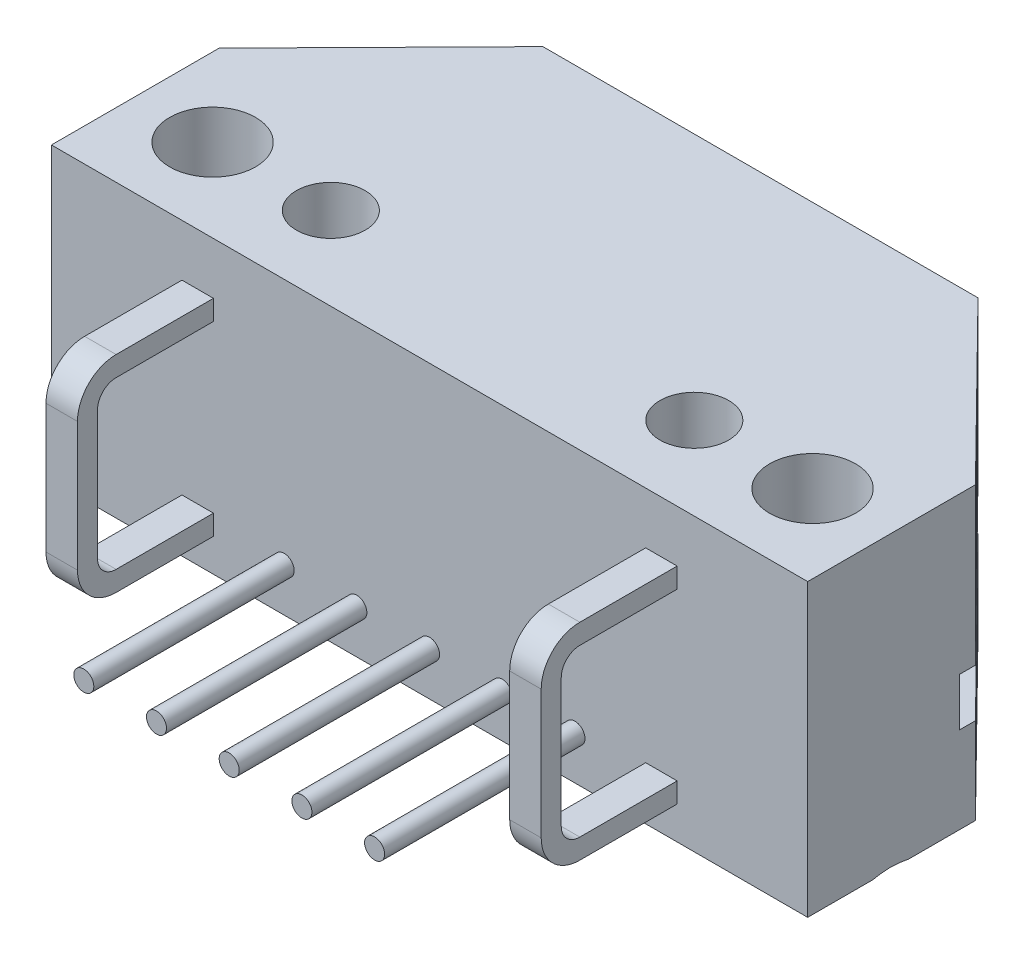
ISO-10303-21;
HEADER;
FILE_DESCRIPTION(('STEP AP214'),'2;1');
FILE_NAME('part.step','',(''),(''),'','','');
FILE_SCHEMA(('AUTOMOTIVE_DESIGN { 1 0 10303 214 1 1 1 1 }'));
ENDSEC;
DATA;
#1=APPLICATION_CONTEXT('core data for automotive mechanical design processes');
#2=APPLICATION_PROTOCOL_DEFINITION('international standard','automotive_design',2000,#1);
#3=PRODUCT_CONTEXT('',#1,'mechanical');
#4=PRODUCT('Part','Part','',(#3));
#5=PRODUCT_RELATED_PRODUCT_CATEGORY('part','',(#4));
#6=PRODUCT_DEFINITION_FORMATION('','',#4);
#7=PRODUCT_DEFINITION_CONTEXT('part definition',#1,'design');
#8=PRODUCT_DEFINITION('design','',#6,#7);
#9=PRODUCT_DEFINITION_SHAPE('','',#8);
#10=(LENGTH_UNIT() NAMED_UNIT(*) SI_UNIT(.MILLI.,.METRE.));
#11=(NAMED_UNIT(*) PLANE_ANGLE_UNIT() SI_UNIT($,.RADIAN.));
#12=(NAMED_UNIT(*) SI_UNIT($,.STERADIAN.) SOLID_ANGLE_UNIT());
#13=UNCERTAINTY_MEASURE_WITH_UNIT(LENGTH_MEASURE(1.E-05),#10,'distance_accuracy_value','');
#14=(GEOMETRIC_REPRESENTATION_CONTEXT(3) GLOBAL_UNCERTAINTY_ASSIGNED_CONTEXT((#13)) GLOBAL_UNIT_ASSIGNED_CONTEXT((#10,
#11,#12)) REPRESENTATION_CONTEXT('',''));
#15=CARTESIAN_POINT('',(0.,0.,0.));
#16=DIRECTION('',(0.,0.,1.));
#17=DIRECTION('',(1.,0.,0.));
#18=AXIS2_PLACEMENT_3D('',#15,#16,#17);
#19=CARTESIAN_POINT('',(0.,-3.42,0.));
#20=DIRECTION('',(0.,1.,0.));
#21=DIRECTION('',(0.,0.,1.));
#22=AXIS2_PLACEMENT_3D('',#19,#20,#21);
#23=PLANE('',#22);
#24=CARTESIAN_POINT('',(10.48,-3.42,15.75));
#25=DIRECTION('',(0.,-1.,0.));
#26=DIRECTION('',(0.,0.,-1.));
#27=AXIS2_PLACEMENT_3D('',#24,#25,#26);
#28=CIRCLE('',#27,2.8);
#29=CARTESIAN_POINT('',(13.21,-3.42,16.3721736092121));
#30=VERTEX_POINT('',#29);
#31=CARTESIAN_POINT('',(13.21,-3.42,15.1278263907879));
#32=VERTEX_POINT('',#31);
#33=EDGE_CURVE('E49',#30,#32,#28,.T.);
#34=ORIENTED_EDGE('',*,*,#33,.F.);
#35=DIRECTION('',(0.,0.,-1.));
#36=VECTOR('',#35,1.);
#37=CARTESIAN_POINT('',(13.21,-3.42,18.65));
#38=LINE('',#37,#36);
#39=CARTESIAN_POINT('',(13.21,-3.42,18.65));
#40=VERTEX_POINT('',#39);
#41=EDGE_CURVE('E285',#40,#30,#38,.T.);
#42=ORIENTED_EDGE('',*,*,#41,.F.);
#43=DIRECTION('',(1.,0.,0.));
#44=VECTOR('',#43,1.);
#45=CARTESIAN_POINT('',(-13.21,-3.42,18.65));
#46=LINE('',#45,#44);
#47=CARTESIAN_POINT('',(-13.21,-3.42,18.65));
#48=VERTEX_POINT('',#47);
#49=EDGE_CURVE('E299',#48,#40,#46,.T.);
#50=ORIENTED_EDGE('',*,*,#49,.F.);
#51=DIRECTION('',(0.,0.,1.));
#52=VECTOR('',#51,1.);
#53=CARTESIAN_POINT('',(-13.21,-3.42,18.65));
#54=LINE('',#53,#52);
#55=CARTESIAN_POINT('',(-13.21,-3.42,16.3721736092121));
#56=VERTEX_POINT('',#55);
#57=EDGE_CURVE('E308',#56,#48,#54,.T.);
#58=ORIENTED_EDGE('',*,*,#57,.F.);
#59=CARTESIAN_POINT('',(-10.48,-3.42,15.75));
#60=DIRECTION('',(0.,-1.,0.));
#61=DIRECTION('',(0.,0.,-1.));
#62=AXIS2_PLACEMENT_3D('',#59,#60,#61);
#63=CIRCLE('',#62,2.8);
#64=CARTESIAN_POINT('',(-13.21,-3.42,15.1278263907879));
#65=VERTEX_POINT('',#64);
#66=EDGE_CURVE('E56',#65,#56,#63,.T.);
#67=ORIENTED_EDGE('',*,*,#66,.F.);
#68=CARTESIAN_POINT('',(-13.21,-3.42,12.79));
#69=VERTEX_POINT('',#68);
#70=EDGE_CURVE('E309',#69,#65,#54,.T.);
#71=ORIENTED_EDGE('',*,*,#70,.F.);
#72=DIRECTION('',(-0.701457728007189,0.,0.712711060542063));
#73=VECTOR('',#72,1.);
#74=CARTESIAN_POINT('',(-13.21,-3.42,12.79));
#75=LINE('',#74,#73);
#76=CARTESIAN_POINT('',(-7.6,-3.42,7.09));
#77=VERTEX_POINT('',#76);
#78=EDGE_CURVE('E305',#77,#69,#75,.T.);
#79=ORIENTED_EDGE('',*,*,#78,.F.);
#80=DIRECTION('',(-1.,0.,0.));
#81=VECTOR('',#80,1.);
#82=CARTESIAN_POINT('',(-7.6,-3.42,7.09));
#83=LINE('',#82,#81);
#84=CARTESIAN_POINT('',(7.6,-3.42,7.09));
#85=VERTEX_POINT('',#84);
#86=EDGE_CURVE('E297',#85,#77,#83,.T.);
#87=ORIENTED_EDGE('',*,*,#86,.F.);
#88=DIRECTION('',(-0.701457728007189,0.,-0.712711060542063));
#89=VECTOR('',#88,1.);
#90=CARTESIAN_POINT('',(13.21,-3.42,12.79));
#91=LINE('',#90,#89);
#92=CARTESIAN_POINT('',(13.21,-3.42,12.79));
#93=VERTEX_POINT('',#92);
#94=EDGE_CURVE('E294',#93,#85,#91,.T.);
#95=ORIENTED_EDGE('',*,*,#94,.F.);
#96=EDGE_CURVE('E288',#32,#93,#38,.T.);
#97=ORIENTED_EDGE('',*,*,#96,.F.);
#98=EDGE_LOOP('',(#34,#42,#50,#58,#67,#71,#79,#87,#95,#97));
#99=FACE_BOUND('',#98,.T.);
#100=ADVANCED_FACE('F35',(#99),#23,.F.);
#101=CARTESIAN_POINT('',(-13.21,-3.42,18.65));
#102=DIRECTION('',(0.,0.,1.));
#103=DIRECTION('',(1.,0.,0.));
#104=AXIS2_PLACEMENT_3D('',#101,#102,#103);
#105=PLANE('',#104);
#106=CARTESIAN_POINT('',(-2.54,-1.9,18.65));
#107=DIRECTION('',(0.,0.,1.));
#108=DIRECTION('',(-1.,0.,0.));
#109=AXIS2_PLACEMENT_3D('',#106,#107,#108);
#110=CIRCLE('',#109,0.35);
#111=CARTESIAN_POINT('',(-2.89,-1.9,18.65));
#112=VERTEX_POINT('',#111);
#113=EDGE_CURVE('E395',#112,#112,#110,.T.);
#114=ORIENTED_EDGE('',*,*,#113,.F.);
#115=EDGE_LOOP('',(#114));
#116=FACE_BOUND('',#115,.T.);
#117=CARTESIAN_POINT('',(2.54,-1.9,18.65));
#118=DIRECTION('',(0.,0.,1.));
#119=DIRECTION('',(1.,0.,0.));
#120=AXIS2_PLACEMENT_3D('',#117,#118,#119);
#121=CIRCLE('',#120,0.35);
#122=CARTESIAN_POINT('',(2.89,-1.9,18.65));
#123=VERTEX_POINT('',#122);
#124=EDGE_CURVE('E399',#123,#123,#121,.T.);
#125=ORIENTED_EDGE('',*,*,#124,.F.);
#126=EDGE_LOOP('',(#125));
#127=FACE_BOUND('',#126,.T.);
#128=DIRECTION('',(0.,1.,0.));
#129=VECTOR('',#128,1.);
#130=CARTESIAN_POINT('',(13.21,-3.42,18.65));
#131=LINE('',#130,#129);
#132=CARTESIAN_POINT('',(13.21,6.74,18.65));
#133=VERTEX_POINT('',#132);
#134=EDGE_CURVE('E293',#40,#133,#131,.T.);
#135=ORIENTED_EDGE('',*,*,#134,.T.);
#136=DIRECTION('',(1.,0.,0.));
#137=VECTOR('',#136,1.);
#138=CARTESIAN_POINT('',(-13.21,6.74,18.65));
#139=LINE('',#138,#137);
#140=CARTESIAN_POINT('',(-13.21,6.74,18.65));
#141=VERTEX_POINT('',#140);
#142=EDGE_CURVE('E623',#141,#133,#139,.T.);
#143=ORIENTED_EDGE('',*,*,#142,.F.);
#144=DIRECTION('',(0.,1.,0.));
#145=VECTOR('',#144,1.);
#146=CARTESIAN_POINT('',(-13.21,-3.42,18.65));
#147=LINE('',#146,#145);
#148=EDGE_CURVE('E312',#48,#141,#147,.T.);
#149=ORIENTED_EDGE('',*,*,#148,.F.);
#150=ORIENTED_EDGE('',*,*,#49,.T.);
#151=EDGE_LOOP('',(#135,#143,#149,#150));
#152=FACE_BOUND('',#151,.T.);
#153=CARTESIAN_POINT('',(0.,-1.9,18.65));
#154=DIRECTION('',(0.,0.,1.));
#155=DIRECTION('',(1.,0.,0.));
#156=AXIS2_PLACEMENT_3D('',#153,#154,#155);
#157=CIRCLE('',#156,0.35);
#158=CARTESIAN_POINT('',(0.350000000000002,-1.9,18.65));
#159=VERTEX_POINT('',#158);
#160=EDGE_CURVE('E405',#159,#159,#157,.T.);
#161=ORIENTED_EDGE('',*,*,#160,.F.);
#162=EDGE_LOOP('',(#161));
#163=FACE_BOUND('',#162,.T.);
#164=CARTESIAN_POINT('',(5.08,-1.9,18.65));
#165=DIRECTION('',(0.,0.,1.));
#166=DIRECTION('',(1.,0.,0.));
#167=AXIS2_PLACEMENT_3D('',#164,#165,#166);
#168=CIRCLE('',#167,0.35);
#169=CARTESIAN_POINT('',(5.43,-1.9,18.65));
#170=VERTEX_POINT('',#169);
#171=EDGE_CURVE('E409',#170,#170,#168,.T.);
#172=ORIENTED_EDGE('',*,*,#171,.F.);
#173=EDGE_LOOP('',(#172));
#174=FACE_BOUND('',#173,.T.);
#175=CARTESIAN_POINT('',(-5.08,-1.9,18.65));
#176=DIRECTION('',(0.,0.,1.));
#177=DIRECTION('',(-1.,0.,0.));
#178=AXIS2_PLACEMENT_3D('',#175,#176,#177);
#179=CIRCLE('',#178,0.35);
#180=CARTESIAN_POINT('',(-5.43,-1.9,18.65));
#181=VERTEX_POINT('',#180);
#182=EDGE_CURVE('E413',#181,#181,#179,.T.);
#183=ORIENTED_EDGE('',*,*,#182,.F.);
#184=EDGE_LOOP('',(#183));
#185=FACE_BOUND('',#184,.T.);
#186=DIRECTION('',(1.,0.,0.));
#187=VECTOR('',#186,1.);
#188=CARTESIAN_POINT('',(7.55,4.23,18.65));
#189=LINE('',#188,#187);
#190=CARTESIAN_POINT('',(7.55,4.23,18.65));
#191=VERTEX_POINT('',#190);
#192=CARTESIAN_POINT('',(8.65,4.23,18.65));
#193=VERTEX_POINT('',#192);
#194=EDGE_CURVE('E416',#191,#193,#189,.T.);
#195=ORIENTED_EDGE('',*,*,#194,.F.);
#196=DIRECTION('',(0.,-1.,0.));
#197=VECTOR('',#196,1.);
#198=CARTESIAN_POINT('',(7.55,4.93,18.65));
#199=LINE('',#198,#197);
#200=CARTESIAN_POINT('',(7.55,4.93,18.65));
#201=VERTEX_POINT('',#200);
#202=EDGE_CURVE('E511',#201,#191,#199,.T.);
#203=ORIENTED_EDGE('',*,*,#202,.F.);
#204=DIRECTION('',(1.,0.,0.));
#205=VECTOR('',#204,1.);
#206=CARTESIAN_POINT('',(7.55,4.93,18.65));
#207=LINE('',#206,#205);
#208=CARTESIAN_POINT('',(8.65,4.93,18.65));
#209=VERTEX_POINT('',#208);
#210=EDGE_CURVE('E557',#201,#209,#207,.T.);
#211=ORIENTED_EDGE('',*,*,#210,.T.);
#212=DIRECTION('',(0.,-1.,0.));
#213=VECTOR('',#212,1.);
#214=CARTESIAN_POINT('',(8.65,4.93,18.65));
#215=LINE('',#214,#213);
#216=EDGE_CURVE('E477',#209,#193,#215,.T.);
#217=ORIENTED_EDGE('',*,*,#216,.T.);
#218=EDGE_LOOP('',(#195,#203,#211,#217));
#219=FACE_BOUND('',#218,.T.);
#220=DIRECTION('',(1.,0.,0.));
#221=VECTOR('',#220,1.);
#222=CARTESIAN_POINT('',(7.55,-2.27,18.65));
#223=LINE('',#222,#221);
#224=CARTESIAN_POINT('',(7.55,-2.27,18.65));
#225=VERTEX_POINT('',#224);
#226=CARTESIAN_POINT('',(8.65,-2.27,18.65));
#227=VERTEX_POINT('',#226);
#228=EDGE_CURVE('E420',#225,#227,#223,.T.);
#229=ORIENTED_EDGE('',*,*,#228,.F.);
#230=DIRECTION('',(0.,-1.,0.));
#231=VECTOR('',#230,1.);
#232=CARTESIAN_POINT('',(7.55,-1.57,18.65));
#233=LINE('',#232,#231);
#234=CARTESIAN_POINT('',(7.55,-1.57,18.65));
#235=VERTEX_POINT('',#234);
#236=EDGE_CURVE('E524',#235,#225,#233,.T.);
#237=ORIENTED_EDGE('',*,*,#236,.F.);
#238=DIRECTION('',(1.,0.,0.));
#239=VECTOR('',#238,1.);
#240=CARTESIAN_POINT('',(7.55,-1.57,18.65));
#241=LINE('',#240,#239);
#242=CARTESIAN_POINT('',(8.65,-1.57,18.65));
#243=VERTEX_POINT('',#242);
#244=EDGE_CURVE('E546',#235,#243,#241,.T.);
#245=ORIENTED_EDGE('',*,*,#244,.T.);
#246=DIRECTION('',(0.,-1.,0.));
#247=VECTOR('',#246,1.);
#248=CARTESIAN_POINT('',(8.65,-1.57,18.65));
#249=LINE('',#248,#247);
#250=EDGE_CURVE('E494',#243,#227,#249,.T.);
#251=ORIENTED_EDGE('',*,*,#250,.T.);
#252=EDGE_LOOP('',(#229,#237,#245,#251));
#253=FACE_BOUND('',#252,.T.);
#254=DIRECTION('',(-1.,0.,0.));
#255=VECTOR('',#254,1.);
#256=CARTESIAN_POINT('',(-7.55,-1.57,18.65));
#257=LINE('',#256,#255);
#258=CARTESIAN_POINT('',(-7.55,-1.57,18.65));
#259=VERTEX_POINT('',#258);
#260=CARTESIAN_POINT('',(-8.65,-1.57,18.65));
#261=VERTEX_POINT('',#260);
#262=EDGE_CURVE('E424',#259,#261,#257,.T.);
#263=ORIENTED_EDGE('',*,*,#262,.F.);
#264=DIRECTION('',(0.,-1.,0.));
#265=VECTOR('',#264,1.);
#266=CARTESIAN_POINT('',(-7.55,-1.57,18.65));
#267=LINE('',#266,#265);
#268=CARTESIAN_POINT('',(-7.55,-2.27,18.65));
#269=VERTEX_POINT('',#268);
#270=EDGE_CURVE('E696',#259,#269,#267,.T.);
#271=ORIENTED_EDGE('',*,*,#270,.T.);
#272=DIRECTION('',(-1.,0.,0.));
#273=VECTOR('',#272,1.);
#274=CARTESIAN_POINT('',(-7.55,-2.27,18.65));
#275=LINE('',#274,#273);
#276=CARTESIAN_POINT('',(-8.65,-2.27,18.65));
#277=VERTEX_POINT('',#276);
#278=EDGE_CURVE('E467',#269,#277,#275,.T.);
#279=ORIENTED_EDGE('',*,*,#278,.T.);
#280=DIRECTION('',(0.,-1.,0.));
#281=VECTOR('',#280,1.);
#282=CARTESIAN_POINT('',(-8.65,-1.57,18.65));
#283=LINE('',#282,#281);
#284=EDGE_CURVE('E669',#261,#277,#283,.T.);
#285=ORIENTED_EDGE('',*,*,#284,.F.);
#286=EDGE_LOOP('',(#263,#271,#279,#285));
#287=FACE_BOUND('',#286,.T.);
#288=DIRECTION('',(-1.,0.,0.));
#289=VECTOR('',#288,1.);
#290=CARTESIAN_POINT('',(-7.55,4.93,18.65));
#291=LINE('',#290,#289);
#292=CARTESIAN_POINT('',(-7.55,4.93,18.65));
#293=VERTEX_POINT('',#292);
#294=CARTESIAN_POINT('',(-8.65,4.93,18.65));
#295=VERTEX_POINT('',#294);
#296=EDGE_CURVE('E427',#293,#295,#291,.T.);
#297=ORIENTED_EDGE('',*,*,#296,.F.);
#298=DIRECTION('',(0.,-1.,0.));
#299=VECTOR('',#298,1.);
#300=CARTESIAN_POINT('',(-7.55,4.93,18.65));
#301=LINE('',#300,#299);
#302=CARTESIAN_POINT('',(-7.55,4.23,18.65));
#303=VERTEX_POINT('',#302);
#304=EDGE_CURVE('E430',#293,#303,#301,.T.);
#305=ORIENTED_EDGE('',*,*,#304,.T.);
#306=DIRECTION('',(-1.,0.,0.));
#307=VECTOR('',#306,1.);
#308=CARTESIAN_POINT('',(-7.55,4.23,18.65));
#309=LINE('',#308,#307);
#310=CARTESIAN_POINT('',(-8.65,4.23,18.65));
#311=VERTEX_POINT('',#310);
#312=EDGE_CURVE('E437',#303,#311,#309,.T.);
#313=ORIENTED_EDGE('',*,*,#312,.T.);
#314=DIRECTION('',(0.,-1.,0.));
#315=VECTOR('',#314,1.);
#316=CARTESIAN_POINT('',(-8.65,4.93,18.65));
#317=LINE('',#316,#315);
#318=EDGE_CURVE('E433',#295,#311,#317,.T.);
#319=ORIENTED_EDGE('',*,*,#318,.F.);
#320=EDGE_LOOP('',(#297,#305,#313,#319));
#321=FACE_BOUND('',#320,.T.);
#322=ADVANCED_FACE('F37',(#116,#127,#152,#163,#174,#185,#219,#253,#287,#321),#105,.T.);
#323=CARTESIAN_POINT('',(-13.21,-3.42,12.79));
#324=DIRECTION('',(-0.712711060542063,0.,-0.701457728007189));
#325=DIRECTION('',(-0.701457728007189,0.,0.712711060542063));
#326=AXIS2_PLACEMENT_3D('',#323,#324,#325);
#327=PLANE('',#326);
#328=DIRECTION('',(0.701457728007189,0.,-0.712711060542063));
#329=VECTOR('',#328,1.);
#330=CARTESIAN_POINT('',(-13.21,1.28,12.79));
#331=LINE('',#330,#329);
#332=CARTESIAN_POINT('',(-13.21,1.28,12.79));
#333=VERTEX_POINT('',#332);
#334=CARTESIAN_POINT('',(-7.6,1.28,7.09));
#335=VERTEX_POINT('',#334);
#336=EDGE_CURVE('E621',#333,#335,#331,.T.);
#337=ORIENTED_EDGE('',*,*,#336,.F.);
#338=DIRECTION('',(0.,1.,0.));
#339=VECTOR('',#338,1.);
#340=CARTESIAN_POINT('',(-13.21,-3.42,12.79));
#341=LINE('',#340,#339);
#342=CARTESIAN_POINT('',(-13.21,6.74,12.79));
#343=VERTEX_POINT('',#342);
#344=EDGE_CURVE('E318',#333,#343,#341,.T.);
#345=ORIENTED_EDGE('',*,*,#344,.T.);
#346=DIRECTION('',(-0.701457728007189,0.,0.712711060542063));
#347=VECTOR('',#346,1.);
#348=CARTESIAN_POINT('',(-13.21,6.74,12.79));
#349=LINE('',#348,#347);
#350=CARTESIAN_POINT('',(-7.6,6.74,7.09));
#351=VERTEX_POINT('',#350);
#352=EDGE_CURVE('E635',#351,#343,#349,.T.);
#353=ORIENTED_EDGE('',*,*,#352,.F.);
#354=DIRECTION('',(0.,1.,0.));
#355=VECTOR('',#354,1.);
#356=CARTESIAN_POINT('',(-7.6,-3.42,7.09));
#357=LINE('',#356,#355);
#358=EDGE_CURVE('E322',#335,#351,#357,.T.);
#359=ORIENTED_EDGE('',*,*,#358,.F.);
#360=EDGE_LOOP('',(#337,#345,#353,#359));
#361=FACE_BOUND('',#360,.T.);
#362=ADVANCED_FACE('F357',(#361),#327,.T.);
#363=CARTESIAN_POINT('',(-7.6,-3.42,7.09));
#364=DIRECTION('',(0.,0.,-1.));
#365=DIRECTION('',(-1.,0.,0.));
#366=AXIS2_PLACEMENT_3D('',#363,#364,#365);
#367=PLANE('',#366);
#368=DIRECTION('',(1.,0.,0.));
#369=VECTOR('',#368,1.);
#370=CARTESIAN_POINT('',(-7.6,1.28,7.09));
#371=LINE('',#370,#369);
#372=CARTESIAN_POINT('',(7.6,1.28,7.09));
#373=VERTEX_POINT('',#372);
#374=EDGE_CURVE('E619',#335,#373,#371,.T.);
#375=ORIENTED_EDGE('',*,*,#374,.F.);
#376=ORIENTED_EDGE('',*,*,#358,.T.);
#377=DIRECTION('',(-1.,0.,0.));
#378=VECTOR('',#377,1.);
#379=CARTESIAN_POINT('',(-7.6,6.74,7.09));
#380=LINE('',#379,#378);
#381=CARTESIAN_POINT('',(7.6,6.74,7.09));
#382=VERTEX_POINT('',#381);
#383=EDGE_CURVE('E632',#382,#351,#380,.T.);
#384=ORIENTED_EDGE('',*,*,#383,.F.);
#385=DIRECTION('',(0.,1.,0.));
#386=VECTOR('',#385,1.);
#387=CARTESIAN_POINT('',(7.6,-3.42,7.09));
#388=LINE('',#387,#386);
#389=EDGE_CURVE('E326',#373,#382,#388,.T.);
#390=ORIENTED_EDGE('',*,*,#389,.F.);
#391=EDGE_LOOP('',(#375,#376,#384,#390));
#392=FACE_BOUND('',#391,.T.);
#393=ADVANCED_FACE('F362',(#392),#367,.T.);
#394=CARTESIAN_POINT('',(13.21,-3.42,12.79));
#395=DIRECTION('',(0.712711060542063,0.,-0.701457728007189));
#396=DIRECTION('',(-0.701457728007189,0.,-0.712711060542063));
#397=AXIS2_PLACEMENT_3D('',#394,#395,#396);
#398=PLANE('',#397);
#399=DIRECTION('',(0.701457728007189,0.,0.712711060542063));
#400=VECTOR('',#399,1.);
#401=CARTESIAN_POINT('',(13.21,1.28,12.79));
#402=LINE('',#401,#400);
#403=CARTESIAN_POINT('',(13.21,1.28,12.79));
#404=VERTEX_POINT('',#403);
#405=EDGE_CURVE('E617',#373,#404,#402,.T.);
#406=ORIENTED_EDGE('',*,*,#405,.F.);
#407=ORIENTED_EDGE('',*,*,#389,.T.);
#408=DIRECTION('',(-0.701457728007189,0.,-0.712711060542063));
#409=VECTOR('',#408,1.);
#410=CARTESIAN_POINT('',(13.21,6.74,12.79));
#411=LINE('',#410,#409);
#412=CARTESIAN_POINT('',(13.21,6.74,12.79));
#413=VERTEX_POINT('',#412);
#414=EDGE_CURVE('E629',#413,#382,#411,.T.);
#415=ORIENTED_EDGE('',*,*,#414,.F.);
#416=DIRECTION('',(0.,1.,0.));
#417=VECTOR('',#416,1.);
#418=CARTESIAN_POINT('',(13.21,-3.42,12.79));
#419=LINE('',#418,#417);
#420=EDGE_CURVE('E330',#404,#413,#419,.T.);
#421=ORIENTED_EDGE('',*,*,#420,.F.);
#422=EDGE_LOOP('',(#406,#407,#415,#421));
#423=FACE_BOUND('',#422,.T.);
#424=ADVANCED_FACE('F350',(#423),#398,.T.);
#425=CARTESIAN_POINT('',(-13.21,-3.42,18.65));
#426=DIRECTION('',(-1.,0.,0.));
#427=DIRECTION('',(0.,0.,1.));
#428=AXIS2_PLACEMENT_3D('',#425,#426,#427);
#429=PLANE('',#428);
#430=CARTESIAN_POINT('',(-13.21,-6.14978705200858,10.9410869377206));
#431=CARTESIAN_POINT('',(-13.21,-6.06777829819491,11.0353985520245));
#432=CARTESIAN_POINT('',(-13.21,-5.98609436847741,11.1299946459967));
#433=CARTESIAN_POINT('',(-13.21,-5.82351209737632,11.3198682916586));
#434=CARTESIAN_POINT('',(-13.21,-5.74261379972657,11.4151458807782));
#435=CARTESIAN_POINT('',(-13.21,-5.58160664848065,11.606652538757));
#436=CARTESIAN_POINT('',(-13.21,-5.501499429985,11.7028829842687));
#437=CARTESIAN_POINT('',(-13.21,-5.34240826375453,11.8962662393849));
#438=CARTESIAN_POINT('',(-13.21,-5.26342429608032,11.9934190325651));
#439=CARTESIAN_POINT('',(-13.21,-5.10402604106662,12.1922967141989));
#440=CARTESIAN_POINT('',(-13.21,-5.0236610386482,12.2940611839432));
#441=CARTESIAN_POINT('',(-13.21,-4.8647361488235,12.4989891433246));
#442=CARTESIAN_POINT('',(-13.21,-4.78617621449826,12.6021525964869));
#443=CARTESIAN_POINT('',(-13.21,-4.63137172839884,12.8100982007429));
#444=CARTESIAN_POINT('',(-13.21,-4.55512562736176,12.9148791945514));
#445=CARTESIAN_POINT('',(-13.21,-4.40552180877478,13.1264765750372));
#446=CARTESIAN_POINT('',(-13.21,-4.33216381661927,13.2332927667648));
#447=CARTESIAN_POINT('',(-13.21,-4.18448315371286,13.4565075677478));
#448=CARTESIAN_POINT('',(-13.21,-4.11041352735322,13.5730747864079));
#449=CARTESIAN_POINT('',(-13.21,-3.96793091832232,13.8097229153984));
#450=CARTESIAN_POINT('',(-13.21,-3.89952047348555,13.92980536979));
#451=CARTESIAN_POINT('',(-13.21,-3.77104802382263,14.1730470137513));
#452=CARTESIAN_POINT('',(-13.21,-3.71091740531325,14.2961695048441));
#453=CARTESIAN_POINT('',(-13.21,-3.60119142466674,14.5469703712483));
#454=CARTESIAN_POINT('',(-13.21,-3.55158393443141,14.6746433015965));
#455=CARTESIAN_POINT('',(-13.21,-3.47553475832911,14.9070686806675));
#456=CARTESIAN_POINT('',(-13.21,-3.44641089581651,15.0109335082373));
#457=CARTESIAN_POINT('',(-13.21,-3.39885852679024,15.221215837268));
#458=CARTESIAN_POINT('',(-13.21,-3.38043503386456,15.3276345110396));
#459=CARTESIAN_POINT('',(-13.21,-3.36037995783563,15.5023797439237));
#460=CARTESIAN_POINT('',(-13.21,-3.35506263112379,15.5702962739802));
#461=CARTESIAN_POINT('',(-13.21,-3.34950399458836,15.7063465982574));
#462=CARTESIAN_POINT('',(-13.21,-3.34926282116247,15.7744803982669));
#463=CARTESIAN_POINT('',(-13.21,-3.3538700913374,15.9105094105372));
#464=CARTESIAN_POINT('',(-13.21,-3.35871376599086,15.9784047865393));
#465=CARTESIAN_POINT('',(-13.21,-3.37329463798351,16.1136731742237));
#466=CARTESIAN_POINT('',(-13.21,-3.38303290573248,16.1810460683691));
#467=CARTESIAN_POINT('',(-13.21,-3.41367658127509,16.351775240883));
#468=CARTESIAN_POINT('',(-13.21,-3.43777781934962,16.4545644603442));
#469=CARTESIAN_POINT('',(-13.21,-3.49523727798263,16.6575214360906));
#470=CARTESIAN_POINT('',(-13.21,-3.52860141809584,16.7576874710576));
#471=CARTESIAN_POINT('',(-13.21,-3.60326020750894,16.9564568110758));
#472=CARTESIAN_POINT('',(-13.21,-3.64465161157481,17.0550232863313));
#473=CARTESIAN_POINT('',(-13.21,-3.73343183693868,17.2493426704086));
#474=CARTESIAN_POINT('',(-13.21,-3.78081863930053,17.3450965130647));
#475=CARTESIAN_POINT('',(-13.21,-3.87670062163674,17.5272894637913));
#476=CARTESIAN_POINT('',(-13.21,-3.92486904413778,17.6139021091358));
#477=CARTESIAN_POINT('',(-13.21,-4.02445103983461,17.7852485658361));
#478=CARTESIAN_POINT('',(-13.21,-4.07586513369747,17.8699820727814));
#479=CARTESIAN_POINT('',(-13.21,-4.23406277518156,18.1218600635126));
#480=CARTESIAN_POINT('',(-13.21,-4.34473437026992,18.2865585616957));
#481=CARTESIAN_POINT('',(-13.21,-4.57338683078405,18.6117694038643));
#482=CARTESIAN_POINT('',(-13.21,-4.6913968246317,18.7722609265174));
#483=CARTESIAN_POINT('',(-13.21,-4.93215790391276,19.0895304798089));
#484=CARTESIAN_POINT('',(-13.21,-5.05490708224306,19.246309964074));
#485=CARTESIAN_POINT('',(-13.21,-5.29272818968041,19.5432369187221));
#486=CARTESIAN_POINT('',(-13.21,-5.40750759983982,19.6836200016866));
#487=CARTESIAN_POINT('',(-13.21,-5.63924826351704,19.9625975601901));
#488=CARTESIAN_POINT('',(-13.21,-5.75620976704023,20.1011918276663));
#489=CARTESIAN_POINT('',(-13.21,-5.99071404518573,20.375658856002));
#490=CARTESIAN_POINT('',(-13.21,-6.10824126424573,20.5115449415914));
#491=CARTESIAN_POINT('',(-13.21,-6.34459678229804,20.7821334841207));
#492=CARTESIAN_POINT('',(-13.21,-6.46342481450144,20.9168361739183));
#493=CARTESIAN_POINT('',(-13.21,-6.58275398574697,21.0510881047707));
#494=B_SPLINE_CURVE_WITH_KNOTS('',3,(#430,#431,#432,#433,#434,#435,#436,#437,#438,#439,#440,
#441,#442,#443,#444,#445,#446,#447,#448,#449,#450,#451,#452,#453,#454,#455,#456,#457,#458,#459,
#460,#461,#462,#463,#464,#465,#466,#467,#468,#469,#470,#471,#472,#473,#474,#475,#476,#477,#478,
#479,#480,#481,#482,#483,#484,#485,#486,#487,#488,#489,#490,#491,#492,#493),.UNSPECIFIED.,.F.,
.F.,(4,2,2,2,2,2,2,2,2,2,2,2,2,2,2,2,2,2,2,2,2,2,2,2,2,2,2,2,2,2,2,4),(0.,0.374942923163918,
0.749906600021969,1.12552849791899,1.50114371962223,1.89014008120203,2.27912632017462,
2.66784608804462,3.05652880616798,3.47073788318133,3.88513171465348,4.2958530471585,
4.70609841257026,5.02925844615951,5.35256977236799,5.55677180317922,5.76097932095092,
5.96499548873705,6.16905629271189,6.48523063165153,6.80160749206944,7.12206576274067,
7.44241640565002,7.73964930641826,8.03693001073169,8.63191241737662,9.22942938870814,
9.82670836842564,10.3706824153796,10.914719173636,11.4536897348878,11.9925517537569),.UNSPECIFIED.);
#495=EDGE_CURVE('E44',#56,#65,#494,.F.);
#496=ORIENTED_EDGE('',*,*,#495,.F.);
#497=ORIENTED_EDGE('',*,*,#57,.T.);
#498=ORIENTED_EDGE('',*,*,#148,.T.);
#499=DIRECTION('',(0.,0.,1.));
#500=VECTOR('',#499,1.);
#501=CARTESIAN_POINT('',(-13.21,6.74,18.65));
#502=LINE('',#501,#500);
#503=EDGE_CURVE('E637',#343,#141,#502,.T.);
#504=ORIENTED_EDGE('',*,*,#503,.F.);
#505=ORIENTED_EDGE('',*,*,#344,.F.);
#506=DIRECTION('',(0.,0.,1.));
#507=VECTOR('',#506,1.);
#508=CARTESIAN_POINT('',(-13.21,1.28,13.35));
#509=LINE('',#508,#507);
#510=CARTESIAN_POINT('',(-13.21,1.28,13.35));
#511=VERTEX_POINT('',#510);
#512=EDGE_CURVE('E602',#333,#511,#509,.T.);
#513=ORIENTED_EDGE('',*,*,#512,.T.);
#514=DIRECTION('',(0.,-1.,0.));
#515=VECTOR('',#514,1.);
#516=CARTESIAN_POINT('',(-13.21,1.28,13.35));
#517=LINE('',#516,#515);
#518=CARTESIAN_POINT('',(-13.21,-0.4,13.35));
#519=VERTEX_POINT('',#518);
#520=EDGE_CURVE('E596',#511,#519,#517,.T.);
#521=ORIENTED_EDGE('',*,*,#520,.T.);
#522=DIRECTION('',(0.,0.,-1.));
#523=VECTOR('',#522,1.);
#524=CARTESIAN_POINT('',(-13.21,-0.4,13.35));
#525=LINE('',#524,#523);
#526=CARTESIAN_POINT('',(-13.21,-0.4,12.79));
#527=VERTEX_POINT('',#526);
#528=EDGE_CURVE('E599',#519,#527,#525,.T.);
#529=ORIENTED_EDGE('',*,*,#528,.T.);
#530=EDGE_CURVE('E315',#69,#527,#341,.T.);
#531=ORIENTED_EDGE('',*,*,#530,.F.);
#532=ORIENTED_EDGE('',*,*,#70,.T.);
#533=EDGE_LOOP('',(#496,#497,#498,#504,#505,#513,#521,#529,#531,#532));
#534=FACE_BOUND('',#533,.T.);
#535=ADVANCED_FACE('F344',(#534),#429,.T.);
#536=DIRECTION('',(-0.701457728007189,0.,0.712711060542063));
#537=VECTOR('',#536,1.);
#538=CARTESIAN_POINT('',(-13.21,-0.4,12.79));
#539=LINE('',#538,#537);
#540=CARTESIAN_POINT('',(-7.6,-0.4,7.09));
#541=VERTEX_POINT('',#540);
#542=EDGE_CURVE('E615',#541,#527,#539,.T.);
#543=ORIENTED_EDGE('',*,*,#542,.F.);
#544=EDGE_CURVE('E319',#77,#541,#357,.T.);
#545=ORIENTED_EDGE('',*,*,#544,.F.);
#546=ORIENTED_EDGE('',*,*,#78,.T.);
#547=ORIENTED_EDGE('',*,*,#530,.T.);
#548=EDGE_LOOP('',(#543,#545,#546,#547));
#549=FACE_BOUND('',#548,.T.);
#550=ADVANCED_FACE('F349',(#549),#327,.T.);
#551=DIRECTION('',(-1.,0.,0.));
#552=VECTOR('',#551,1.);
#553=CARTESIAN_POINT('',(-7.6,-0.4,7.09));
#554=LINE('',#553,#552);
#555=CARTESIAN_POINT('',(7.6,-0.4,7.09));
#556=VERTEX_POINT('',#555);
#557=EDGE_CURVE('E613',#556,#541,#554,.T.);
#558=ORIENTED_EDGE('',*,*,#557,.F.);
#559=EDGE_CURVE('E323',#85,#556,#388,.T.);
#560=ORIENTED_EDGE('',*,*,#559,.F.);
#561=ORIENTED_EDGE('',*,*,#86,.T.);
#562=ORIENTED_EDGE('',*,*,#544,.T.);
#563=EDGE_LOOP('',(#558,#560,#561,#562));
#564=FACE_BOUND('',#563,.T.);
#565=ADVANCED_FACE('F355',(#564),#367,.T.);
#566=DIRECTION('',(-0.701457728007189,0.,-0.712711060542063));
#567=VECTOR('',#566,1.);
#568=CARTESIAN_POINT('',(13.21,-0.4,12.79));
#569=LINE('',#568,#567);
#570=CARTESIAN_POINT('',(13.21,-0.4,12.79));
#571=VERTEX_POINT('',#570);
#572=EDGE_CURVE('E609',#571,#556,#569,.T.);
#573=ORIENTED_EDGE('',*,*,#572,.F.);
#574=EDGE_CURVE('E327',#93,#571,#419,.T.);
#575=ORIENTED_EDGE('',*,*,#574,.F.);
#576=ORIENTED_EDGE('',*,*,#94,.T.);
#577=ORIENTED_EDGE('',*,*,#559,.T.);
#578=EDGE_LOOP('',(#573,#575,#576,#577));
#579=FACE_BOUND('',#578,.T.);
#580=ADVANCED_FACE('F360',(#579),#398,.T.);
#581=CARTESIAN_POINT('',(13.21,-3.42,18.65));
#582=DIRECTION('',(1.,0.,0.));
#583=DIRECTION('',(0.,0.,-1.));
#584=AXIS2_PLACEMENT_3D('',#581,#582,#583);
#585=PLANE('',#584);
#586=CARTESIAN_POINT('',(13.21,-6.14978705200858,10.9410869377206));
#587=CARTESIAN_POINT('',(13.21,-6.06777829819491,11.0353985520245));
#588=CARTESIAN_POINT('',(13.21,-5.98609436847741,11.1299946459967));
#589=CARTESIAN_POINT('',(13.21,-5.82351209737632,11.3198682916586));
#590=CARTESIAN_POINT('',(13.21,-5.74261379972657,11.4151458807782));
#591=CARTESIAN_POINT('',(13.21,-5.58160664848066,11.606652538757));
#592=CARTESIAN_POINT('',(13.21,-5.50149942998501,11.7028829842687));
#593=CARTESIAN_POINT('',(13.21,-5.34240826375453,11.8962662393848));
#594=CARTESIAN_POINT('',(13.21,-5.26342429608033,11.9934190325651));
#595=CARTESIAN_POINT('',(13.21,-5.10402604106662,12.1922967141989));
#596=CARTESIAN_POINT('',(13.21,-5.0236610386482,12.2940611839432));
#597=CARTESIAN_POINT('',(13.21,-4.8647361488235,12.4989891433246));
#598=CARTESIAN_POINT('',(13.21,-4.78617621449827,12.6021525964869));
#599=CARTESIAN_POINT('',(13.21,-4.63137172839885,12.8100982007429));
#600=CARTESIAN_POINT('',(13.21,-4.55512562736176,12.9148791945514));
#601=CARTESIAN_POINT('',(13.21,-4.40552180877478,13.1264765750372));
#602=CARTESIAN_POINT('',(13.21,-4.33216381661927,13.2332927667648));
#603=CARTESIAN_POINT('',(13.21,-4.18448315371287,13.4565075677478));
#604=CARTESIAN_POINT('',(13.21,-4.11041352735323,13.5730747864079));
#605=CARTESIAN_POINT('',(13.21,-3.96793091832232,13.8097229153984));
#606=CARTESIAN_POINT('',(13.21,-3.89952047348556,13.92980536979));
#607=CARTESIAN_POINT('',(13.21,-3.77104802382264,14.1730470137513));
#608=CARTESIAN_POINT('',(13.21,-3.71091740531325,14.2961695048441));
#609=CARTESIAN_POINT('',(13.21,-3.60119142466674,14.5469703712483));
#610=CARTESIAN_POINT('',(13.21,-3.55158393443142,14.6746433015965));
#611=CARTESIAN_POINT('',(13.21,-3.47553475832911,14.9070686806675));
#612=CARTESIAN_POINT('',(13.21,-3.44641089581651,15.0109335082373));
#613=CARTESIAN_POINT('',(13.21,-3.39885852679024,15.221215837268));
#614=CARTESIAN_POINT('',(13.21,-3.38043503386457,15.3276345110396));
#615=CARTESIAN_POINT('',(13.21,-3.36037995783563,15.5023797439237));
#616=CARTESIAN_POINT('',(13.21,-3.35506263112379,15.5702962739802));
#617=CARTESIAN_POINT('',(13.21,-3.34950399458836,15.7063465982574));
#618=CARTESIAN_POINT('',(13.21,-3.34926282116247,15.7744803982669));
#619=CARTESIAN_POINT('',(13.21,-3.3538700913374,15.9105094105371));
#620=CARTESIAN_POINT('',(13.21,-3.35871376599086,15.9784047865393));
#621=CARTESIAN_POINT('',(13.21,-3.37329463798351,16.1136731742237));
#622=CARTESIAN_POINT('',(13.21,-3.38303290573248,16.1810460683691));
#623=CARTESIAN_POINT('',(13.21,-3.41367658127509,16.351775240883));
#624=CARTESIAN_POINT('',(13.21,-3.43777781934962,16.4545644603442));
#625=CARTESIAN_POINT('',(13.21,-3.49523727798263,16.6575214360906));
#626=CARTESIAN_POINT('',(13.21,-3.52860141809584,16.7576874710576));
#627=CARTESIAN_POINT('',(13.21,-3.60326020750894,16.9564568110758));
#628=CARTESIAN_POINT('',(13.21,-3.64465161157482,17.0550232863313));
#629=CARTESIAN_POINT('',(13.21,-3.73343183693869,17.2493426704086));
#630=CARTESIAN_POINT('',(13.21,-3.78081863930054,17.3450965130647));
#631=CARTESIAN_POINT('',(13.21,-3.87670062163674,17.5272894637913));
#632=CARTESIAN_POINT('',(13.21,-3.92486904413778,17.6139021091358));
#633=CARTESIAN_POINT('',(13.21,-4.02445103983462,17.7852485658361));
#634=CARTESIAN_POINT('',(13.21,-4.07586513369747,17.8699820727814));
#635=CARTESIAN_POINT('',(13.21,-4.23406277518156,18.1218600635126));
#636=CARTESIAN_POINT('',(13.21,-4.34473437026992,18.2865585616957));
#637=CARTESIAN_POINT('',(13.21,-4.57338683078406,18.6117694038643));
#638=CARTESIAN_POINT('',(13.21,-4.69139682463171,18.7722609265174));
#639=CARTESIAN_POINT('',(13.21,-4.93215790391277,19.0895304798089));
#640=CARTESIAN_POINT('',(13.21,-5.05490708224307,19.246309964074));
#641=CARTESIAN_POINT('',(13.21,-5.29272818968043,19.5432369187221));
#642=CARTESIAN_POINT('',(13.21,-5.40750759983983,19.6836200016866));
#643=CARTESIAN_POINT('',(13.21,-5.63924826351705,19.9625975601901));
#644=CARTESIAN_POINT('',(13.21,-5.75620976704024,20.1011918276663));
#645=CARTESIAN_POINT('',(13.21,-5.99071404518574,20.375658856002));
#646=CARTESIAN_POINT('',(13.21,-6.10824126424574,20.5115449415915));
#647=CARTESIAN_POINT('',(13.21,-6.34459678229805,20.7821334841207));
#648=CARTESIAN_POINT('',(13.21,-6.46342481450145,20.9168361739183));
#649=CARTESIAN_POINT('',(13.21,-6.58275398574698,21.0510881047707));
#650=B_SPLINE_CURVE_WITH_KNOTS('',3,(#586,#587,#588,#589,#590,#591,#592,#593,#594,#595,#596,
#597,#598,#599,#600,#601,#602,#603,#604,#605,#606,#607,#608,#609,#610,#611,#612,#613,#614,#615,
#616,#617,#618,#619,#620,#621,#622,#623,#624,#625,#626,#627,#628,#629,#630,#631,#632,#633,#634,
#635,#636,#637,#638,#639,#640,#641,#642,#643,#644,#645,#646,#647,#648,#649),.UNSPECIFIED.,.F.,
.F.,(4,2,2,2,2,2,2,2,2,2,2,2,2,2,2,2,2,2,2,2,2,2,2,2,2,2,2,2,2,2,2,4),(0.,0.374942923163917,
0.749906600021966,1.12552849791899,1.50114371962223,1.89014008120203,2.27912632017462,
2.66784608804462,3.05652880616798,3.47073788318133,3.88513171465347,4.2958530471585,
4.70609841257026,5.02925844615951,5.35256977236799,5.55677180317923,5.76097932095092,
5.96499548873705,6.16905629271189,6.48523063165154,6.80160749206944,7.12206576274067,
7.44241640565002,7.73964930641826,8.03693001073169,8.63191241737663,9.22942938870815,
9.82670836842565,10.3706824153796,10.914719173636,11.4536897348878,11.9925517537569),.UNSPECIFIED.);
#651=EDGE_CURVE('E11',#32,#30,#650,.T.);
#652=ORIENTED_EDGE('',*,*,#651,.F.);
#653=ORIENTED_EDGE('',*,*,#96,.T.);
#654=ORIENTED_EDGE('',*,*,#574,.T.);
#655=DIRECTION('',(0.,0.,-1.));
#656=VECTOR('',#655,1.);
#657=CARTESIAN_POINT('',(13.21,-0.4,13.35));
#658=LINE('',#657,#656);
#659=CARTESIAN_POINT('',(13.21,-0.4,13.35));
#660=VERTEX_POINT('',#659);
#661=EDGE_CURVE('E594',#660,#571,#658,.T.);
#662=ORIENTED_EDGE('',*,*,#661,.F.);
#663=DIRECTION('',(0.,-1.,0.));
#664=VECTOR('',#663,1.);
#665=CARTESIAN_POINT('',(13.21,1.28,13.35));
#666=LINE('',#665,#664);
#667=CARTESIAN_POINT('',(13.21,1.28,13.35));
#668=VERTEX_POINT('',#667);
#669=EDGE_CURVE('E590',#668,#660,#666,.T.);
#670=ORIENTED_EDGE('',*,*,#669,.F.);
#671=DIRECTION('',(0.,0.,1.));
#672=VECTOR('',#671,1.);
#673=CARTESIAN_POINT('',(13.21,1.28,18.65));
#674=LINE('',#673,#672);
#675=EDGE_CURVE('E314',#404,#668,#674,.T.);
#676=ORIENTED_EDGE('',*,*,#675,.F.);
#677=ORIENTED_EDGE('',*,*,#420,.T.);
#678=DIRECTION('',(0.,0.,-1.));
#679=VECTOR('',#678,1.);
#680=CARTESIAN_POINT('',(13.21,6.74,18.65));
#681=LINE('',#680,#679);
#682=EDGE_CURVE('E626',#133,#413,#681,.T.);
#683=ORIENTED_EDGE('',*,*,#682,.F.);
#684=ORIENTED_EDGE('',*,*,#134,.F.);
#685=ORIENTED_EDGE('',*,*,#41,.T.);
#686=EDGE_LOOP('',(#652,#653,#654,#662,#670,#676,#677,#683,#684,#685));
#687=FACE_BOUND('',#686,.T.);
#688=ADVANCED_FACE('F291',(#687),#585,.T.);
#689=CARTESIAN_POINT('',(0.,6.74,0.));
#690=DIRECTION('',(0.,1.,0.));
#691=DIRECTION('',(0.,0.,1.));
#692=AXIS2_PLACEMENT_3D('',#689,#690,#691);
#693=PLANE('',#692);
#694=CARTESIAN_POINT('',(10.48,6.74,15.75));
#695=DIRECTION('',(0.,1.,0.));
#696=DIRECTION('',(0.,0.,1.));
#697=AXIS2_PLACEMENT_3D('',#694,#695,#696);
#698=CIRCLE('',#697,1.5);
#699=CARTESIAN_POINT('',(10.48,6.74,17.25));
#700=VERTEX_POINT('',#699);
#701=EDGE_CURVE('E39',#700,#700,#698,.T.);
#702=ORIENTED_EDGE('',*,*,#701,.F.);
#703=EDGE_LOOP('',(#702));
#704=FACE_BOUND('',#703,.T.);
#705=CARTESIAN_POINT('',(-10.48,6.74,15.75));
#706=DIRECTION('',(0.,1.,0.));
#707=DIRECTION('',(0.,0.,1.));
#708=AXIS2_PLACEMENT_3D('',#705,#706,#707);
#709=CIRCLE('',#708,1.5);
#710=CARTESIAN_POINT('',(-10.48,6.74,17.25));
#711=VERTEX_POINT('',#710);
#712=EDGE_CURVE('E339',#711,#711,#709,.T.);
#713=ORIENTED_EDGE('',*,*,#712,.F.);
#714=EDGE_LOOP('',(#713));
#715=FACE_BOUND('',#714,.T.);
#716=CARTESIAN_POINT('',(-6.35,6.74,15.75));
#717=DIRECTION('',(0.,1.,0.));
#718=DIRECTION('',(0.,0.,-1.));
#719=AXIS2_PLACEMENT_3D('',#716,#717,#718);
#720=CIRCLE('',#719,1.2);
#721=CARTESIAN_POINT('',(-6.35,6.74,14.55));
#722=VERTEX_POINT('',#721);
#723=EDGE_CURVE('E579',#722,#722,#720,.T.);
#724=ORIENTED_EDGE('',*,*,#723,.F.);
#725=EDGE_LOOP('',(#724));
#726=FACE_BOUND('',#725,.T.);
#727=CARTESIAN_POINT('',(6.35,6.74,15.75));
#728=DIRECTION('',(0.,1.,0.));
#729=DIRECTION('',(0.,0.,1.));
#730=AXIS2_PLACEMENT_3D('',#727,#728,#729);
#731=CIRCLE('',#730,1.2);
#732=CARTESIAN_POINT('',(6.35,6.74,16.95));
#733=VERTEX_POINT('',#732);
#734=EDGE_CURVE('E584',#733,#733,#731,.T.);
#735=ORIENTED_EDGE('',*,*,#734,.F.);
#736=EDGE_LOOP('',(#735));
#737=FACE_BOUND('',#736,.T.);
#738=ORIENTED_EDGE('',*,*,#142,.T.);
#739=ORIENTED_EDGE('',*,*,#682,.T.);
#740=ORIENTED_EDGE('',*,*,#414,.T.);
#741=ORIENTED_EDGE('',*,*,#383,.T.);
#742=ORIENTED_EDGE('',*,*,#352,.T.);
#743=ORIENTED_EDGE('',*,*,#503,.T.);
#744=EDGE_LOOP('',(#738,#739,#740,#741,#742,#743));
#745=FACE_BOUND('',#744,.T.);
#746=ADVANCED_FACE('F367',(#704,#715,#726,#737,#745),#693,.T.);
#747=CARTESIAN_POINT('',(-13.21,1.28,13.35));
#748=DIRECTION('',(0.,0.,1.));
#749=DIRECTION('',(1.,0.,0.));
#750=AXIS2_PLACEMENT_3D('',#747,#748,#749);
#751=PLANE('',#750);
#752=DIRECTION('',(1.,0.,0.));
#753=VECTOR('',#752,1.);
#754=CARTESIAN_POINT('',(-13.21,-0.4,13.35));
#755=LINE('',#754,#753);
#756=EDGE_CURVE('E605',#519,#660,#755,.T.);
#757=ORIENTED_EDGE('',*,*,#756,.F.);
#758=ORIENTED_EDGE('',*,*,#520,.F.);
#759=DIRECTION('',(1.,0.,0.));
#760=VECTOR('',#759,1.);
#761=CARTESIAN_POINT('',(-13.21,1.28,13.35));
#762=LINE('',#761,#760);
#763=EDGE_CURVE('E606',#511,#668,#762,.T.);
#764=ORIENTED_EDGE('',*,*,#763,.T.);
#765=ORIENTED_EDGE('',*,*,#669,.T.);
#766=EDGE_LOOP('',(#757,#758,#764,#765));
#767=FACE_BOUND('',#766,.T.);
#768=ADVANCED_FACE('F864',(#767),#751,.F.);
#769=CARTESIAN_POINT('',(-13.21,1.28,13.35));
#770=DIRECTION('',(0.,1.,0.));
#771=DIRECTION('',(0.,0.,1.));
#772=AXIS2_PLACEMENT_3D('',#769,#770,#771);
#773=PLANE('',#772);
#774=ORIENTED_EDGE('',*,*,#336,.T.);
#775=ORIENTED_EDGE('',*,*,#374,.T.);
#776=ORIENTED_EDGE('',*,*,#405,.T.);
#777=ORIENTED_EDGE('',*,*,#675,.T.);
#778=ORIENTED_EDGE('',*,*,#763,.F.);
#779=ORIENTED_EDGE('',*,*,#512,.F.);
#780=EDGE_LOOP('',(#774,#775,#776,#777,#778,#779));
#781=FACE_BOUND('',#780,.T.);
#782=ADVANCED_FACE('F861',(#781),#773,.F.);
#783=CARTESIAN_POINT('',(-13.21,-0.4,13.35));
#784=DIRECTION('',(0.,-1.,0.));
#785=DIRECTION('',(0.,0.,-1.));
#786=AXIS2_PLACEMENT_3D('',#783,#784,#785);
#787=PLANE('',#786);
#788=ORIENTED_EDGE('',*,*,#542,.T.);
#789=ORIENTED_EDGE('',*,*,#528,.F.);
#790=ORIENTED_EDGE('',*,*,#756,.T.);
#791=ORIENTED_EDGE('',*,*,#661,.T.);
#792=ORIENTED_EDGE('',*,*,#572,.T.);
#793=ORIENTED_EDGE('',*,*,#557,.T.);
#794=EDGE_LOOP('',(#788,#789,#790,#791,#792,#793));
#795=FACE_BOUND('',#794,.T.);
#796=ADVANCED_FACE('F859',(#795),#787,.F.);
#797=CARTESIAN_POINT('',(6.35,4.58,15.75));
#798=DIRECTION('',(0.,1.,0.));
#799=DIRECTION('',(0.,0.,1.));
#800=AXIS2_PLACEMENT_3D('',#797,#798,#799);
#801=CYLINDRICAL_SURFACE('',#800,1.2);
#802=CARTESIAN_POINT('',(6.35,4.58,15.75));
#803=DIRECTION('',(0.,1.,0.));
#804=DIRECTION('',(0.,0.,1.));
#805=AXIS2_PLACEMENT_3D('',#802,#803,#804);
#806=CIRCLE('',#805,1.2);
#807=CARTESIAN_POINT('',(6.35,4.58,16.95));
#808=VERTEX_POINT('',#807);
#809=EDGE_CURVE('E587',#808,#808,#806,.T.);
#810=ORIENTED_EDGE('',*,*,#809,.F.);
#811=EDGE_LOOP('',(#810));
#812=FACE_BOUND('',#811,.T.);
#813=ORIENTED_EDGE('',*,*,#734,.T.);
#814=EDGE_LOOP('',(#813));
#815=FACE_BOUND('',#814,.T.);
#816=ADVANCED_FACE('F855',(#812,#815),#801,.F.);
#817=CARTESIAN_POINT('',(6.35,4.58,15.75));
#818=DIRECTION('',(0.,1.,0.));
#819=DIRECTION('',(0.,0.,1.));
#820=AXIS2_PLACEMENT_3D('',#817,#818,#819);
#821=PLANE('',#820);
#822=ORIENTED_EDGE('',*,*,#809,.T.);
#823=EDGE_LOOP('',(#822));
#824=FACE_BOUND('',#823,.T.);
#825=ADVANCED_FACE('F851',(#824),#821,.T.);
#826=CARTESIAN_POINT('',(-6.35,4.58,15.75));
#827=DIRECTION('',(0.,1.,0.));
#828=DIRECTION('',(0.,0.,1.));
#829=AXIS2_PLACEMENT_3D('',#826,#827,#828);
#830=CYLINDRICAL_SURFACE('',#829,1.2);
#831=CARTESIAN_POINT('',(-6.35,4.58,15.75));
#832=DIRECTION('',(0.,1.,0.));
#833=DIRECTION('',(0.,0.,-1.));
#834=AXIS2_PLACEMENT_3D('',#831,#832,#833);
#835=CIRCLE('',#834,1.2);
#836=CARTESIAN_POINT('',(-6.35,4.58,14.55));
#837=VERTEX_POINT('',#836);
#838=EDGE_CURVE('E581',#837,#837,#835,.T.);
#839=ORIENTED_EDGE('',*,*,#838,.F.);
#840=EDGE_LOOP('',(#839));
#841=FACE_BOUND('',#840,.T.);
#842=ORIENTED_EDGE('',*,*,#723,.T.);
#843=EDGE_LOOP('',(#842));
#844=FACE_BOUND('',#843,.T.);
#845=ADVANCED_FACE('F847',(#841,#844),#830,.F.);
#846=CARTESIAN_POINT('',(-6.35,4.58,15.75));
#847=DIRECTION('',(0.,-1.,0.));
#848=DIRECTION('',(0.,0.,-1.));
#849=AXIS2_PLACEMENT_3D('',#846,#847,#848);
#850=PLANE('',#849);
#851=ORIENTED_EDGE('',*,*,#838,.T.);
#852=EDGE_LOOP('',(#851));
#853=FACE_BOUND('',#852,.T.);
#854=ADVANCED_FACE('F843',(#853),#850,.F.);
#855=CARTESIAN_POINT('',(0.,-1.9,25.65));
#856=DIRECTION('',(0.,0.,-1.));
#857=DIRECTION('',(-1.,0.,0.));
#858=AXIS2_PLACEMENT_3D('',#855,#856,#857);
#859=CYLINDRICAL_SURFACE('',#858,0.35);
#860=CARTESIAN_POINT('',(0.,-1.9,25.65));
#861=DIRECTION('',(0.,0.,1.));
#862=DIRECTION('',(1.,0.,0.));
#863=AXIS2_PLACEMENT_3D('',#860,#861,#862);
#864=CIRCLE('',#863,0.35);
#865=CARTESIAN_POINT('',(0.350000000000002,-1.9,25.65));
#866=VERTEX_POINT('',#865);
#867=EDGE_CURVE('E576',#866,#866,#864,.T.);
#868=ORIENTED_EDGE('',*,*,#867,.F.);
#869=EDGE_LOOP('',(#868));
#870=FACE_BOUND('',#869,.T.);
#871=ORIENTED_EDGE('',*,*,#160,.T.);
#872=EDGE_LOOP('',(#871));
#873=FACE_BOUND('',#872,.T.);
#874=ADVANCED_FACE('F839',(#870,#873),#859,.T.);
#875=CARTESIAN_POINT('',(0.,-1.9,25.65));
#876=DIRECTION('',(0.,0.,1.));
#877=DIRECTION('',(1.,0.,0.));
#878=AXIS2_PLACEMENT_3D('',#875,#876,#877);
#879=PLANE('',#878);
#880=ORIENTED_EDGE('',*,*,#867,.T.);
#881=EDGE_LOOP('',(#880));
#882=FACE_BOUND('',#881,.T.);
#883=ADVANCED_FACE('F835',(#882),#879,.T.);
#884=CARTESIAN_POINT('',(2.54,-1.9,25.65));
#885=DIRECTION('',(0.,0.,-1.));
#886=DIRECTION('',(-1.,0.,0.));
#887=AXIS2_PLACEMENT_3D('',#884,#885,#886);
#888=CYLINDRICAL_SURFACE('',#887,0.35);
#889=CARTESIAN_POINT('',(2.54,-1.9,25.65));
#890=DIRECTION('',(0.,0.,1.));
#891=DIRECTION('',(1.,0.,0.));
#892=AXIS2_PLACEMENT_3D('',#889,#890,#891);
#893=CIRCLE('',#892,0.35);
#894=CARTESIAN_POINT('',(2.89,-1.9,25.65));
#895=VERTEX_POINT('',#894);
#896=EDGE_CURVE('E572',#895,#895,#893,.T.);
#897=ORIENTED_EDGE('',*,*,#896,.F.);
#898=EDGE_LOOP('',(#897));
#899=FACE_BOUND('',#898,.T.);
#900=ORIENTED_EDGE('',*,*,#124,.T.);
#901=EDGE_LOOP('',(#900));
#902=FACE_BOUND('',#901,.T.);
#903=ADVANCED_FACE('F831',(#899,#902),#888,.T.);
#904=CARTESIAN_POINT('',(2.54,-1.9,25.65));
#905=DIRECTION('',(0.,0.,1.));
#906=DIRECTION('',(1.,0.,0.));
#907=AXIS2_PLACEMENT_3D('',#904,#905,#906);
#908=PLANE('',#907);
#909=ORIENTED_EDGE('',*,*,#896,.T.);
#910=EDGE_LOOP('',(#909));
#911=FACE_BOUND('',#910,.T.);
#912=ADVANCED_FACE('F827',(#911),#908,.T.);
#913=CARTESIAN_POINT('',(5.08,-1.9,25.65));
#914=DIRECTION('',(0.,0.,-1.));
#915=DIRECTION('',(-1.,0.,0.));
#916=AXIS2_PLACEMENT_3D('',#913,#914,#915);
#917=CYLINDRICAL_SURFACE('',#916,0.35);
#918=CARTESIAN_POINT('',(5.08,-1.9,25.65));
#919=DIRECTION('',(0.,0.,1.));
#920=DIRECTION('',(1.,0.,0.));
#921=AXIS2_PLACEMENT_3D('',#918,#919,#920);
#922=CIRCLE('',#921,0.35);
#923=CARTESIAN_POINT('',(5.43,-1.9,25.65));
#924=VERTEX_POINT('',#923);
#925=EDGE_CURVE('E568',#924,#924,#922,.T.);
#926=ORIENTED_EDGE('',*,*,#925,.F.);
#927=EDGE_LOOP('',(#926));
#928=FACE_BOUND('',#927,.T.);
#929=ORIENTED_EDGE('',*,*,#171,.T.);
#930=EDGE_LOOP('',(#929));
#931=FACE_BOUND('',#930,.T.);
#932=ADVANCED_FACE('F823',(#928,#931),#917,.T.);
#933=CARTESIAN_POINT('',(5.08,-1.9,25.65));
#934=DIRECTION('',(0.,0.,1.));
#935=DIRECTION('',(1.,0.,0.));
#936=AXIS2_PLACEMENT_3D('',#933,#934,#935);
#937=PLANE('',#936);
#938=ORIENTED_EDGE('',*,*,#925,.T.);
#939=EDGE_LOOP('',(#938));
#940=FACE_BOUND('',#939,.T.);
#941=ADVANCED_FACE('F819',(#940),#937,.T.);
#942=CARTESIAN_POINT('',(-2.54,-1.9,25.65));
#943=DIRECTION('',(0.,0.,-1.));
#944=DIRECTION('',(-1.,0.,0.));
#945=AXIS2_PLACEMENT_3D('',#942,#943,#944);
#946=CYLINDRICAL_SURFACE('',#945,0.35);
#947=CARTESIAN_POINT('',(-2.54,-1.9,25.65));
#948=DIRECTION('',(0.,0.,1.));
#949=DIRECTION('',(-1.,0.,0.));
#950=AXIS2_PLACEMENT_3D('',#947,#948,#949);
#951=CIRCLE('',#950,0.35);
#952=CARTESIAN_POINT('',(-2.89,-1.9,25.65));
#953=VERTEX_POINT('',#952);
#954=EDGE_CURVE('E564',#953,#953,#951,.T.);
#955=ORIENTED_EDGE('',*,*,#954,.F.);
#956=EDGE_LOOP('',(#955));
#957=FACE_BOUND('',#956,.T.);
#958=ORIENTED_EDGE('',*,*,#113,.T.);
#959=EDGE_LOOP('',(#958));
#960=FACE_BOUND('',#959,.T.);
#961=ADVANCED_FACE('F815',(#957,#960),#946,.T.);
#962=CARTESIAN_POINT('',(-2.54,-1.9,25.65));
#963=DIRECTION('',(0.,0.,-1.));
#964=DIRECTION('',(-1.,0.,0.));
#965=AXIS2_PLACEMENT_3D('',#962,#963,#964);
#966=PLANE('',#965);
#967=ORIENTED_EDGE('',*,*,#954,.T.);
#968=EDGE_LOOP('',(#967));
#969=FACE_BOUND('',#968,.T.);
#970=ADVANCED_FACE('F811',(#969),#966,.F.);
#971=CARTESIAN_POINT('',(-5.08,-1.9,25.65));
#972=DIRECTION('',(0.,0.,-1.));
#973=DIRECTION('',(-1.,0.,0.));
#974=AXIS2_PLACEMENT_3D('',#971,#972,#973);
#975=CYLINDRICAL_SURFACE('',#974,0.35);
#976=CARTESIAN_POINT('',(-5.08,-1.9,25.65));
#977=DIRECTION('',(0.,0.,1.));
#978=DIRECTION('',(-1.,0.,0.));
#979=AXIS2_PLACEMENT_3D('',#976,#977,#978);
#980=CIRCLE('',#979,0.35);
#981=CARTESIAN_POINT('',(-5.43,-1.9,25.65));
#982=VERTEX_POINT('',#981);
#983=EDGE_CURVE('E560',#982,#982,#980,.T.);
#984=ORIENTED_EDGE('',*,*,#983,.F.);
#985=EDGE_LOOP('',(#984));
#986=FACE_BOUND('',#985,.T.);
#987=ORIENTED_EDGE('',*,*,#182,.T.);
#988=EDGE_LOOP('',(#987));
#989=FACE_BOUND('',#988,.T.);
#990=ADVANCED_FACE('F807',(#986,#989),#975,.T.);
#991=CARTESIAN_POINT('',(-5.08,-1.9,25.65));
#992=DIRECTION('',(0.,0.,-1.));
#993=DIRECTION('',(-1.,0.,0.));
#994=AXIS2_PLACEMENT_3D('',#991,#992,#993);
#995=PLANE('',#994);
#996=ORIENTED_EDGE('',*,*,#983,.T.);
#997=EDGE_LOOP('',(#996));
#998=FACE_BOUND('',#997,.T.);
#999=ADVANCED_FACE('F803',(#998),#995,.F.);
#1000=CARTESIAN_POINT('',(7.55,4.23,22.05));
#1001=DIRECTION('',(0.,-1.,0.));
#1002=DIRECTION('',(0.,0.,-1.));
#1003=AXIS2_PLACEMENT_3D('',#1000,#1001,#1002);
#1004=PLANE('',#1003);
#1005=ORIENTED_EDGE('',*,*,#194,.T.);
#1006=DIRECTION('',(0.,0.,-1.));
#1007=VECTOR('',#1006,1.);
#1008=CARTESIAN_POINT('',(8.65,4.23,22.05));
#1009=LINE('',#1008,#1007);
#1010=CARTESIAN_POINT('',(8.65,4.23,22.05));
#1011=VERTEX_POINT('',#1010);
#1012=EDGE_CURVE('E458',#1011,#193,#1009,.T.);
#1013=ORIENTED_EDGE('',*,*,#1012,.F.);
#1014=DIRECTION('',(1.,0.,0.));
#1015=VECTOR('',#1014,1.);
#1016=CARTESIAN_POINT('',(7.55,4.23,22.05));
#1017=LINE('',#1016,#1015);
#1018=CARTESIAN_POINT('',(7.55,4.23,22.05));
#1019=VERTEX_POINT('',#1018);
#1020=EDGE_CURVE('E538',#1019,#1011,#1017,.T.);
#1021=ORIENTED_EDGE('',*,*,#1020,.F.);
#1022=DIRECTION('',(0.,0.,-1.));
#1023=VECTOR('',#1022,1.);
#1024=CARTESIAN_POINT('',(7.55,4.23,22.05));
#1025=LINE('',#1024,#1023);
#1026=EDGE_CURVE('E508',#1019,#191,#1025,.T.);
#1027=ORIENTED_EDGE('',*,*,#1026,.T.);
#1028=EDGE_LOOP('',(#1005,#1013,#1021,#1027));
#1029=FACE_BOUND('',#1028,.T.);
#1030=ADVANCED_FACE('F769',(#1029),#1004,.T.);
#1031=CARTESIAN_POINT('',(7.55,3.58,22.05));
#1032=DIRECTION('',(1.,0.,0.));
#1033=DIRECTION('',(0.,0.,-1.));
#1034=AXIS2_PLACEMENT_3D('',#1031,#1032,#1033);
#1035=CYLINDRICAL_SURFACE('',#1034,0.65);
#1036=ORIENTED_EDGE('',*,*,#1020,.T.);
#1037=CARTESIAN_POINT('',(8.65,3.58,22.05));
#1038=DIRECTION('',(1.,0.,0.));
#1039=DIRECTION('',(0.,0.,-1.));
#1040=AXIS2_PLACEMENT_3D('',#1037,#1038,#1039);
#1041=CIRCLE('',#1040,0.65);
#1042=CARTESIAN_POINT('',(8.65,3.58,22.7));
#1043=VERTEX_POINT('',#1042);
#1044=EDGE_CURVE('E505',#1043,#1011,#1041,.F.);
#1045=ORIENTED_EDGE('',*,*,#1044,.F.);
#1046=DIRECTION('',(1.,0.,0.));
#1047=VECTOR('',#1046,1.);
#1048=CARTESIAN_POINT('',(7.55,3.58,22.7));
#1049=LINE('',#1048,#1047);
#1050=CARTESIAN_POINT('',(7.55,3.58,22.7));
#1051=VERTEX_POINT('',#1050);
#1052=EDGE_CURVE('E540',#1051,#1043,#1049,.T.);
#1053=ORIENTED_EDGE('',*,*,#1052,.F.);
#1054=CARTESIAN_POINT('',(7.55,3.58,22.05));
#1055=DIRECTION('',(1.,0.,0.));
#1056=DIRECTION('',(0.,0.,-1.));
#1057=AXIS2_PLACEMENT_3D('',#1054,#1055,#1056);
#1058=CIRCLE('',#1057,0.65);
#1059=EDGE_CURVE('E535',#1051,#1019,#1058,.F.);
#1060=ORIENTED_EDGE('',*,*,#1059,.T.);
#1061=EDGE_LOOP('',(#1036,#1045,#1053,#1060));
#1062=FACE_BOUND('',#1061,.T.);
#1063=ADVANCED_FACE('F765',(#1062),#1035,.F.);
#1064=CARTESIAN_POINT('',(7.55,-0.92,22.7));
#1065=DIRECTION('',(0.,0.,-1.));
#1066=DIRECTION('',(-1.,0.,0.));
#1067=AXIS2_PLACEMENT_3D('',#1064,#1065,#1066);
#1068=PLANE('',#1067);
#1069=ORIENTED_EDGE('',*,*,#1052,.T.);
#1070=DIRECTION('',(0.,1.,0.));
#1071=VECTOR('',#1070,1.);
#1072=CARTESIAN_POINT('',(8.65,-0.92,22.7));
#1073=LINE('',#1072,#1071);
#1074=CARTESIAN_POINT('',(8.65,-0.92,22.7));
#1075=VERTEX_POINT('',#1074);
#1076=EDGE_CURVE('E502',#1075,#1043,#1073,.T.);
#1077=ORIENTED_EDGE('',*,*,#1076,.F.);
#1078=DIRECTION('',(1.,0.,0.));
#1079=VECTOR('',#1078,1.);
#1080=CARTESIAN_POINT('',(7.55,-0.92,22.7));
#1081=LINE('',#1080,#1079);
#1082=CARTESIAN_POINT('',(7.55,-0.92,22.7));
#1083=VERTEX_POINT('',#1082);
#1084=EDGE_CURVE('E542',#1083,#1075,#1081,.T.);
#1085=ORIENTED_EDGE('',*,*,#1084,.F.);
#1086=DIRECTION('',(0.,1.,0.));
#1087=VECTOR('',#1086,1.);
#1088=CARTESIAN_POINT('',(7.55,-0.92,22.7));
#1089=LINE('',#1088,#1087);
#1090=EDGE_CURVE('E532',#1083,#1051,#1089,.T.);
#1091=ORIENTED_EDGE('',*,*,#1090,.T.);
#1092=EDGE_LOOP('',(#1069,#1077,#1085,#1091));
#1093=FACE_BOUND('',#1092,.T.);
#1094=ADVANCED_FACE('F768',(#1093),#1068,.T.);
#1095=CARTESIAN_POINT('',(7.55,-0.92,22.05));
#1096=DIRECTION('',(1.,0.,0.));
#1097=DIRECTION('',(0.,0.,-1.));
#1098=AXIS2_PLACEMENT_3D('',#1095,#1096,#1097);
#1099=CYLINDRICAL_SURFACE('',#1098,0.65);
#1100=ORIENTED_EDGE('',*,*,#1084,.T.);
#1101=CARTESIAN_POINT('',(8.65,-0.92,22.05));
#1102=DIRECTION('',(1.,0.,0.));
#1103=DIRECTION('',(0.,0.,-1.));
#1104=AXIS2_PLACEMENT_3D('',#1101,#1102,#1103);
#1105=CIRCLE('',#1104,0.65);
#1106=CARTESIAN_POINT('',(8.65,-1.57,22.05));
#1107=VERTEX_POINT('',#1106);
#1108=EDGE_CURVE('E499',#1107,#1075,#1105,.F.);
#1109=ORIENTED_EDGE('',*,*,#1108,.F.);
#1110=DIRECTION('',(1.,0.,0.));
#1111=VECTOR('',#1110,1.);
#1112=CARTESIAN_POINT('',(7.55,-1.57,22.05));
#1113=LINE('',#1112,#1111);
#1114=CARTESIAN_POINT('',(7.55,-1.57,22.05));
#1115=VERTEX_POINT('',#1114);
#1116=EDGE_CURVE('E544',#1115,#1107,#1113,.T.);
#1117=ORIENTED_EDGE('',*,*,#1116,.F.);
#1118=CARTESIAN_POINT('',(7.55,-0.92,22.05));
#1119=DIRECTION('',(1.,0.,0.));
#1120=DIRECTION('',(0.,0.,-1.));
#1121=AXIS2_PLACEMENT_3D('',#1118,#1119,#1120);
#1122=CIRCLE('',#1121,0.65);
#1123=EDGE_CURVE('E529',#1115,#1083,#1122,.F.);
#1124=ORIENTED_EDGE('',*,*,#1123,.T.);
#1125=EDGE_LOOP('',(#1100,#1109,#1117,#1124));
#1126=FACE_BOUND('',#1125,.T.);
#1127=ADVANCED_FACE('F773',(#1126),#1099,.F.);
#1128=CARTESIAN_POINT('',(7.55,-1.57,18.65));
#1129=DIRECTION('',(0.,1.,0.));
#1130=DIRECTION('',(0.,0.,1.));
#1131=AXIS2_PLACEMENT_3D('',#1128,#1129,#1130);
#1132=PLANE('',#1131);
#1133=ORIENTED_EDGE('',*,*,#1116,.T.);
#1134=DIRECTION('',(0.,0.,1.));
#1135=VECTOR('',#1134,1.);
#1136=CARTESIAN_POINT('',(8.65,-1.57,18.65));
#1137=LINE('',#1136,#1135);
#1138=EDGE_CURVE('E496',#243,#1107,#1137,.T.);
#1139=ORIENTED_EDGE('',*,*,#1138,.F.);
#1140=ORIENTED_EDGE('',*,*,#244,.F.);
#1141=DIRECTION('',(0.,0.,1.));
#1142=VECTOR('',#1141,1.);
#1143=CARTESIAN_POINT('',(7.55,-1.57,18.65));
#1144=LINE('',#1143,#1142);
#1145=EDGE_CURVE('E526',#235,#1115,#1144,.T.);
#1146=ORIENTED_EDGE('',*,*,#1145,.T.);
#1147=EDGE_LOOP('',(#1133,#1139,#1140,#1146));
#1148=FACE_BOUND('',#1147,.T.);
#1149=ADVANCED_FACE('F777',(#1148),#1132,.T.);
#1150=CARTESIAN_POINT('',(7.55,-2.27,18.65));
#1151=DIRECTION('',(0.,1.,0.));
#1152=DIRECTION('',(0.,0.,1.));
#1153=AXIS2_PLACEMENT_3D('',#1150,#1151,#1152);
#1154=PLANE('',#1153);
#1155=ORIENTED_EDGE('',*,*,#228,.T.);
#1156=DIRECTION('',(0.,0.,1.));
#1157=VECTOR('',#1156,1.);
#1158=CARTESIAN_POINT('',(8.65,-2.27,18.65));
#1159=LINE('',#1158,#1157);
#1160=CARTESIAN_POINT('',(8.65,-2.27,22.05));
#1161=VERTEX_POINT('',#1160);
#1162=EDGE_CURVE('E491',#227,#1161,#1159,.T.);
#1163=ORIENTED_EDGE('',*,*,#1162,.T.);
#1164=DIRECTION('',(1.,0.,0.));
#1165=VECTOR('',#1164,1.);
#1166=CARTESIAN_POINT('',(7.55,-2.27,22.05));
#1167=LINE('',#1166,#1165);
#1168=CARTESIAN_POINT('',(7.55,-2.27,22.05));
#1169=VERTEX_POINT('',#1168);
#1170=EDGE_CURVE('E549',#1169,#1161,#1167,.T.);
#1171=ORIENTED_EDGE('',*,*,#1170,.F.);
#1172=DIRECTION('',(0.,0.,1.));
#1173=VECTOR('',#1172,1.);
#1174=CARTESIAN_POINT('',(7.55,-2.27,18.65));
#1175=LINE('',#1174,#1173);
#1176=EDGE_CURVE('E522',#225,#1169,#1175,.T.);
#1177=ORIENTED_EDGE('',*,*,#1176,.F.);
#1178=EDGE_LOOP('',(#1155,#1163,#1171,#1177));
#1179=FACE_BOUND('',#1178,.T.);
#1180=ADVANCED_FACE('F781',(#1179),#1154,.F.);
#1181=CARTESIAN_POINT('',(7.55,-0.92,22.05));
#1182=DIRECTION('',(1.,0.,0.));
#1183=DIRECTION('',(0.,0.,-1.));
#1184=AXIS2_PLACEMENT_3D('',#1181,#1182,#1183);
#1185=CYLINDRICAL_SURFACE('',#1184,1.35);
#1186=ORIENTED_EDGE('',*,*,#1170,.T.);
#1187=CARTESIAN_POINT('',(8.65,-0.92,22.05));
#1188=DIRECTION('',(1.,0.,0.));
#1189=DIRECTION('',(0.,0.,-1.));
#1190=AXIS2_PLACEMENT_3D('',#1187,#1188,#1189);
#1191=CIRCLE('',#1190,1.35);
#1192=CARTESIAN_POINT('',(8.65,-0.92,23.4));
#1193=VERTEX_POINT('',#1192);
#1194=EDGE_CURVE('E488',#1161,#1193,#1191,.F.);
#1195=ORIENTED_EDGE('',*,*,#1194,.T.);
#1196=DIRECTION('',(1.,0.,0.));
#1197=VECTOR('',#1196,1.);
#1198=CARTESIAN_POINT('',(7.55,-0.92,23.4));
#1199=LINE('',#1198,#1197);
#1200=CARTESIAN_POINT('',(7.55,-0.92,23.4));
#1201=VERTEX_POINT('',#1200);
#1202=EDGE_CURVE('E551',#1201,#1193,#1199,.T.);
#1203=ORIENTED_EDGE('',*,*,#1202,.F.);
#1204=CARTESIAN_POINT('',(7.55,-0.92,22.05));
#1205=DIRECTION('',(1.,0.,0.));
#1206=DIRECTION('',(0.,0.,-1.));
#1207=AXIS2_PLACEMENT_3D('',#1204,#1205,#1206);
#1208=CIRCLE('',#1207,1.35);
#1209=EDGE_CURVE('E520',#1169,#1201,#1208,.F.);
#1210=ORIENTED_EDGE('',*,*,#1209,.F.);
#1211=EDGE_LOOP('',(#1186,#1195,#1203,#1210));
#1212=FACE_BOUND('',#1211,.T.);
#1213=ADVANCED_FACE('F785',(#1212),#1185,.T.);
#1214=CARTESIAN_POINT('',(7.55,-0.92,23.4));
#1215=DIRECTION('',(0.,0.,-1.));
#1216=DIRECTION('',(-1.,0.,0.));
#1217=AXIS2_PLACEMENT_3D('',#1214,#1215,#1216);
#1218=PLANE('',#1217);
#1219=ORIENTED_EDGE('',*,*,#1202,.T.);
#1220=DIRECTION('',(0.,1.,0.));
#1221=VECTOR('',#1220,1.);
#1222=CARTESIAN_POINT('',(8.65,-0.92,23.4));
#1223=LINE('',#1222,#1221);
#1224=CARTESIAN_POINT('',(8.65,3.58,23.4));
#1225=VERTEX_POINT('',#1224);
#1226=EDGE_CURVE('E485',#1193,#1225,#1223,.T.);
#1227=ORIENTED_EDGE('',*,*,#1226,.T.);
#1228=DIRECTION('',(1.,0.,0.));
#1229=VECTOR('',#1228,1.);
#1230=CARTESIAN_POINT('',(7.55,3.58,23.4));
#1231=LINE('',#1230,#1229);
#1232=CARTESIAN_POINT('',(7.55,3.58,23.4));
#1233=VERTEX_POINT('',#1232);
#1234=EDGE_CURVE('E553',#1233,#1225,#1231,.T.);
#1235=ORIENTED_EDGE('',*,*,#1234,.F.);
#1236=DIRECTION('',(0.,1.,0.));
#1237=VECTOR('',#1236,1.);
#1238=CARTESIAN_POINT('',(7.55,-0.92,23.4));
#1239=LINE('',#1238,#1237);
#1240=EDGE_CURVE('E518',#1201,#1233,#1239,.T.);
#1241=ORIENTED_EDGE('',*,*,#1240,.F.);
#1242=EDGE_LOOP('',(#1219,#1227,#1235,#1241));
#1243=FACE_BOUND('',#1242,.T.);
#1244=ADVANCED_FACE('F789',(#1243),#1218,.F.);
#1245=CARTESIAN_POINT('',(7.55,3.58,22.05));
#1246=DIRECTION('',(1.,0.,0.));
#1247=DIRECTION('',(0.,0.,-1.));
#1248=AXIS2_PLACEMENT_3D('',#1245,#1246,#1247);
#1249=CYLINDRICAL_SURFACE('',#1248,1.35);
#1250=ORIENTED_EDGE('',*,*,#1234,.T.);
#1251=CARTESIAN_POINT('',(8.65,3.58,22.05));
#1252=DIRECTION('',(1.,0.,0.));
#1253=DIRECTION('',(0.,0.,-1.));
#1254=AXIS2_PLACEMENT_3D('',#1251,#1252,#1253);
#1255=CIRCLE('',#1254,1.35);
#1256=CARTESIAN_POINT('',(8.65,4.93,22.05));
#1257=VERTEX_POINT('',#1256);
#1258=EDGE_CURVE('E482',#1225,#1257,#1255,.F.);
#1259=ORIENTED_EDGE('',*,*,#1258,.T.);
#1260=DIRECTION('',(1.,0.,0.));
#1261=VECTOR('',#1260,1.);
#1262=CARTESIAN_POINT('',(7.55,4.93,22.05));
#1263=LINE('',#1262,#1261);
#1264=CARTESIAN_POINT('',(7.55,4.93,22.05));
#1265=VERTEX_POINT('',#1264);
#1266=EDGE_CURVE('E555',#1265,#1257,#1263,.T.);
#1267=ORIENTED_EDGE('',*,*,#1266,.F.);
#1268=CARTESIAN_POINT('',(7.55,3.58,22.05));
#1269=DIRECTION('',(1.,0.,0.));
#1270=DIRECTION('',(0.,0.,-1.));
#1271=AXIS2_PLACEMENT_3D('',#1268,#1269,#1270);
#1272=CIRCLE('',#1271,1.35);
#1273=EDGE_CURVE('E516',#1233,#1265,#1272,.F.);
#1274=ORIENTED_EDGE('',*,*,#1273,.F.);
#1275=EDGE_LOOP('',(#1250,#1259,#1267,#1274));
#1276=FACE_BOUND('',#1275,.T.);
#1277=ADVANCED_FACE('F793',(#1276),#1249,.T.);
#1278=CARTESIAN_POINT('',(7.55,4.93,22.05));
#1279=DIRECTION('',(0.,-1.,0.));
#1280=DIRECTION('',(0.,0.,-1.));
#1281=AXIS2_PLACEMENT_3D('',#1278,#1279,#1280);
#1282=PLANE('',#1281);
#1283=ORIENTED_EDGE('',*,*,#1266,.T.);
#1284=DIRECTION('',(0.,0.,-1.));
#1285=VECTOR('',#1284,1.);
#1286=CARTESIAN_POINT('',(8.65,4.93,22.05));
#1287=LINE('',#1286,#1285);
#1288=EDGE_CURVE('E479',#1257,#209,#1287,.T.);
#1289=ORIENTED_EDGE('',*,*,#1288,.T.);
#1290=ORIENTED_EDGE('',*,*,#210,.F.);
#1291=DIRECTION('',(0.,0.,-1.));
#1292=VECTOR('',#1291,1.);
#1293=CARTESIAN_POINT('',(7.55,4.93,22.05));
#1294=LINE('',#1293,#1292);
#1295=EDGE_CURVE('E513',#1265,#201,#1294,.T.);
#1296=ORIENTED_EDGE('',*,*,#1295,.F.);
#1297=EDGE_LOOP('',(#1283,#1289,#1290,#1296));
#1298=FACE_BOUND('',#1297,.T.);
#1299=ADVANCED_FACE('F763',(#1298),#1282,.F.);
#1300=CARTESIAN_POINT('',(7.55,3.58,22.05));
#1301=DIRECTION('',(1.,0.,0.));
#1302=DIRECTION('',(0.,0.,-1.));
#1303=AXIS2_PLACEMENT_3D('',#1300,#1301,#1302);
#1304=PLANE('',#1303);
#1305=ORIENTED_EDGE('',*,*,#1026,.F.);
#1306=ORIENTED_EDGE('',*,*,#1059,.F.);
#1307=ORIENTED_EDGE('',*,*,#1090,.F.);
#1308=ORIENTED_EDGE('',*,*,#1123,.F.);
#1309=ORIENTED_EDGE('',*,*,#1145,.F.);
#1310=ORIENTED_EDGE('',*,*,#236,.T.);
#1311=ORIENTED_EDGE('',*,*,#1176,.T.);
#1312=ORIENTED_EDGE('',*,*,#1209,.T.);
#1313=ORIENTED_EDGE('',*,*,#1240,.T.);
#1314=ORIENTED_EDGE('',*,*,#1273,.T.);
#1315=ORIENTED_EDGE('',*,*,#1295,.T.);
#1316=ORIENTED_EDGE('',*,*,#202,.T.);
#1317=EDGE_LOOP('',(#1305,#1306,#1307,#1308,#1309,#1310,#1311,#1312,#1313,#1314,#1315,#1316));
#1318=FACE_BOUND('',#1317,.T.);
#1319=ADVANCED_FACE('F755',(#1318),#1304,.F.);
#1320=CARTESIAN_POINT('',(8.65,3.58,22.05));
#1321=DIRECTION('',(1.,0.,0.));
#1322=DIRECTION('',(0.,0.,-1.));
#1323=AXIS2_PLACEMENT_3D('',#1320,#1321,#1322);
#1324=PLANE('',#1323);
#1325=ORIENTED_EDGE('',*,*,#1012,.T.);
#1326=ORIENTED_EDGE('',*,*,#216,.F.);
#1327=ORIENTED_EDGE('',*,*,#1288,.F.);
#1328=ORIENTED_EDGE('',*,*,#1258,.F.);
#1329=ORIENTED_EDGE('',*,*,#1226,.F.);
#1330=ORIENTED_EDGE('',*,*,#1194,.F.);
#1331=ORIENTED_EDGE('',*,*,#1162,.F.);
#1332=ORIENTED_EDGE('',*,*,#250,.F.);
#1333=ORIENTED_EDGE('',*,*,#1138,.T.);
#1334=ORIENTED_EDGE('',*,*,#1108,.T.);
#1335=ORIENTED_EDGE('',*,*,#1076,.T.);
#1336=ORIENTED_EDGE('',*,*,#1044,.T.);
#1337=EDGE_LOOP('',(#1325,#1326,#1327,#1328,#1329,#1330,#1331,#1332,#1333,#1334,#1335,#1336));
#1338=FACE_BOUND('',#1337,.T.);
#1339=ADVANCED_FACE('F748',(#1338),#1324,.T.);
#1340=CARTESIAN_POINT('',(-7.55,4.23,22.05));
#1341=DIRECTION('',(0.,1.,0.));
#1342=DIRECTION('',(0.,0.,1.));
#1343=AXIS2_PLACEMENT_3D('',#1340,#1341,#1342);
#1344=PLANE('',#1343);
#1345=DIRECTION('',(-1.,0.,0.));
#1346=VECTOR('',#1345,1.);
#1347=CARTESIAN_POINT('',(-7.55,4.23,22.05));
#1348=LINE('',#1347,#1346);
#1349=CARTESIAN_POINT('',(-7.55,4.23,22.05));
#1350=VERTEX_POINT('',#1349);
#1351=CARTESIAN_POINT('',(-8.65,4.23,22.05));
#1352=VERTEX_POINT('',#1351);
#1353=EDGE_CURVE('E452',#1350,#1352,#1348,.T.);
#1354=ORIENTED_EDGE('',*,*,#1353,.T.);
#1355=DIRECTION('',(0.,0.,-1.));
#1356=VECTOR('',#1355,1.);
#1357=CARTESIAN_POINT('',(-8.65,4.23,22.05));
#1358=LINE('',#1357,#1356);
#1359=EDGE_CURVE('E651',#1352,#311,#1358,.T.);
#1360=ORIENTED_EDGE('',*,*,#1359,.T.);
#1361=ORIENTED_EDGE('',*,*,#312,.F.);
#1362=DIRECTION('',(0.,0.,-1.));
#1363=VECTOR('',#1362,1.);
#1364=CARTESIAN_POINT('',(-7.55,4.23,22.05));
#1365=LINE('',#1364,#1363);
#1366=EDGE_CURVE('E450',#1350,#303,#1365,.T.);
#1367=ORIENTED_EDGE('',*,*,#1366,.F.);
#1368=EDGE_LOOP('',(#1354,#1360,#1361,#1367));
#1369=FACE_BOUND('',#1368,.T.);
#1370=ADVANCED_FACE('F746',(#1369),#1344,.F.);
#1371=CARTESIAN_POINT('',(-7.55,4.93,22.05));
#1372=DIRECTION('',(0.,1.,0.));
#1373=DIRECTION('',(0.,0.,1.));
#1374=AXIS2_PLACEMENT_3D('',#1371,#1372,#1373);
#1375=PLANE('',#1374);
#1376=ORIENTED_EDGE('',*,*,#296,.T.);
#1377=DIRECTION('',(0.,0.,-1.));
#1378=VECTOR('',#1377,1.);
#1379=CARTESIAN_POINT('',(-8.65,4.93,22.05));
#1380=LINE('',#1379,#1378);
#1381=CARTESIAN_POINT('',(-8.65,4.93,22.05));
#1382=VERTEX_POINT('',#1381);
#1383=EDGE_CURVE('E684',#1382,#295,#1380,.T.);
#1384=ORIENTED_EDGE('',*,*,#1383,.F.);
#1385=DIRECTION('',(-1.,0.,0.));
#1386=VECTOR('',#1385,1.);
#1387=CARTESIAN_POINT('',(-7.55,4.93,22.05));
#1388=LINE('',#1387,#1386);
#1389=CARTESIAN_POINT('',(-7.55,4.93,22.05));
#1390=VERTEX_POINT('',#1389);
#1391=EDGE_CURVE('E438',#1390,#1382,#1388,.T.);
#1392=ORIENTED_EDGE('',*,*,#1391,.F.);
#1393=DIRECTION('',(0.,0.,-1.));
#1394=VECTOR('',#1393,1.);
#1395=CARTESIAN_POINT('',(-7.55,4.93,22.05));
#1396=LINE('',#1395,#1394);
#1397=EDGE_CURVE('E441',#1390,#293,#1396,.T.);
#1398=ORIENTED_EDGE('',*,*,#1397,.T.);
#1399=EDGE_LOOP('',(#1376,#1384,#1392,#1398));
#1400=FACE_BOUND('',#1399,.T.);
#1401=ADVANCED_FACE('F442',(#1400),#1375,.T.);
#1402=CARTESIAN_POINT('',(-7.55,3.58,22.05));
#1403=DIRECTION('',(-1.,0.,0.));
#1404=DIRECTION('',(0.,0.,1.));
#1405=AXIS2_PLACEMENT_3D('',#1402,#1403,#1404);
#1406=CYLINDRICAL_SURFACE('',#1405,1.35);
#1407=ORIENTED_EDGE('',*,*,#1391,.T.);
#1408=CARTESIAN_POINT('',(-8.65,3.58,22.05));
#1409=DIRECTION('',(1.,0.,0.));
#1410=DIRECTION('',(0.,0.,-1.));
#1411=AXIS2_PLACEMENT_3D('',#1408,#1409,#1410);
#1412=CIRCLE('',#1411,1.35);
#1413=CARTESIAN_POINT('',(-8.65,3.58,23.4));
#1414=VERTEX_POINT('',#1413);
#1415=EDGE_CURVE('E681',#1414,#1382,#1412,.F.);
#1416=ORIENTED_EDGE('',*,*,#1415,.F.);
#1417=DIRECTION('',(-1.,0.,0.));
#1418=VECTOR('',#1417,1.);
#1419=CARTESIAN_POINT('',(-7.55,3.58,23.4));
#1420=LINE('',#1419,#1418);
#1421=CARTESIAN_POINT('',(-7.55,3.58,23.4));
#1422=VERTEX_POINT('',#1421);
#1423=EDGE_CURVE('E461',#1422,#1414,#1420,.T.);
#1424=ORIENTED_EDGE('',*,*,#1423,.F.);
#1425=CARTESIAN_POINT('',(-7.55,3.58,22.05));
#1426=DIRECTION('',(1.,0.,0.));
#1427=DIRECTION('',(0.,0.,-1.));
#1428=AXIS2_PLACEMENT_3D('',#1425,#1426,#1427);
#1429=CIRCLE('',#1428,1.35);
#1430=EDGE_CURVE('E446',#1422,#1390,#1429,.F.);
#1431=ORIENTED_EDGE('',*,*,#1430,.T.);
#1432=EDGE_LOOP('',(#1407,#1416,#1424,#1431));
#1433=FACE_BOUND('',#1432,.T.);
#1434=ADVANCED_FACE('F707',(#1433),#1406,.T.);
#1435=CARTESIAN_POINT('',(-7.55,-0.92,23.4));
#1436=DIRECTION('',(0.,0.,1.));
#1437=DIRECTION('',(1.,0.,0.));
#1438=AXIS2_PLACEMENT_3D('',#1435,#1436,#1437);
#1439=PLANE('',#1438);
#1440=ORIENTED_EDGE('',*,*,#1423,.T.);
#1441=DIRECTION('',(0.,1.,0.));
#1442=VECTOR('',#1441,1.);
#1443=CARTESIAN_POINT('',(-8.65,-0.92,23.4));
#1444=LINE('',#1443,#1442);
#1445=CARTESIAN_POINT('',(-8.65,-0.92,23.4));
#1446=VERTEX_POINT('',#1445);
#1447=EDGE_CURVE('E678',#1446,#1414,#1444,.T.);
#1448=ORIENTED_EDGE('',*,*,#1447,.F.);
#1449=DIRECTION('',(-1.,0.,0.));
#1450=VECTOR('',#1449,1.);
#1451=CARTESIAN_POINT('',(-7.55,-0.92,23.4));
#1452=LINE('',#1451,#1450);
#1453=CARTESIAN_POINT('',(-7.55,-0.92,23.4));
#1454=VERTEX_POINT('',#1453);
#1455=EDGE_CURVE('E463',#1454,#1446,#1452,.T.);
#1456=ORIENTED_EDGE('',*,*,#1455,.F.);
#1457=DIRECTION('',(0.,1.,0.));
#1458=VECTOR('',#1457,1.);
#1459=CARTESIAN_POINT('',(-7.55,-0.92,23.4));
#1460=LINE('',#1459,#1458);
#1461=EDGE_CURVE('E704',#1454,#1422,#1460,.T.);
#1462=ORIENTED_EDGE('',*,*,#1461,.T.);
#1463=EDGE_LOOP('',(#1440,#1448,#1456,#1462));
#1464=FACE_BOUND('',#1463,.T.);
#1465=ADVANCED_FACE('F712',(#1464),#1439,.T.);
#1466=CARTESIAN_POINT('',(-7.55,-0.92,22.05));
#1467=DIRECTION('',(-1.,0.,0.));
#1468=DIRECTION('',(0.,0.,1.));
#1469=AXIS2_PLACEMENT_3D('',#1466,#1467,#1468);
#1470=CYLINDRICAL_SURFACE('',#1469,1.35);
#1471=ORIENTED_EDGE('',*,*,#1455,.T.);
#1472=CARTESIAN_POINT('',(-8.65,-0.92,22.05));
#1473=DIRECTION('',(1.,0.,0.));
#1474=DIRECTION('',(0.,0.,-1.));
#1475=AXIS2_PLACEMENT_3D('',#1472,#1473,#1474);
#1476=CIRCLE('',#1475,1.35);
#1477=CARTESIAN_POINT('',(-8.65,-2.27,22.05));
#1478=VERTEX_POINT('',#1477);
#1479=EDGE_CURVE('E675',#1478,#1446,#1476,.F.);
#1480=ORIENTED_EDGE('',*,*,#1479,.F.);
#1481=DIRECTION('',(-1.,0.,0.));
#1482=VECTOR('',#1481,1.);
#1483=CARTESIAN_POINT('',(-7.55,-2.27,22.05));
#1484=LINE('',#1483,#1482);
#1485=CARTESIAN_POINT('',(-7.55,-2.27,22.05));
#1486=VERTEX_POINT('',#1485);
#1487=EDGE_CURVE('E465',#1486,#1478,#1484,.T.);
#1488=ORIENTED_EDGE('',*,*,#1487,.F.);
#1489=CARTESIAN_POINT('',(-7.55,-0.92,22.05));
#1490=DIRECTION('',(1.,0.,0.));
#1491=DIRECTION('',(0.,0.,-1.));
#1492=AXIS2_PLACEMENT_3D('',#1489,#1490,#1491);
#1493=CIRCLE('',#1492,1.35);
#1494=EDGE_CURVE('E701',#1486,#1454,#1493,.F.);
#1495=ORIENTED_EDGE('',*,*,#1494,.T.);
#1496=EDGE_LOOP('',(#1471,#1480,#1488,#1495));
#1497=FACE_BOUND('',#1496,.T.);
#1498=ADVANCED_FACE('F716',(#1497),#1470,.T.);
#1499=CARTESIAN_POINT('',(-7.55,-2.27,18.65));
#1500=DIRECTION('',(0.,-1.,0.));
#1501=DIRECTION('',(0.,0.,-1.));
#1502=AXIS2_PLACEMENT_3D('',#1499,#1500,#1501);
#1503=PLANE('',#1502);
#1504=ORIENTED_EDGE('',*,*,#1487,.T.);
#1505=DIRECTION('',(0.,0.,1.));
#1506=VECTOR('',#1505,1.);
#1507=CARTESIAN_POINT('',(-8.65,-2.27,18.65));
#1508=LINE('',#1507,#1506);
#1509=EDGE_CURVE('E672',#277,#1478,#1508,.T.);
#1510=ORIENTED_EDGE('',*,*,#1509,.F.);
#1511=ORIENTED_EDGE('',*,*,#278,.F.);
#1512=DIRECTION('',(0.,0.,1.));
#1513=VECTOR('',#1512,1.);
#1514=CARTESIAN_POINT('',(-7.55,-2.27,18.65));
#1515=LINE('',#1514,#1513);
#1516=EDGE_CURVE('E698',#269,#1486,#1515,.T.);
#1517=ORIENTED_EDGE('',*,*,#1516,.T.);
#1518=EDGE_LOOP('',(#1504,#1510,#1511,#1517));
#1519=FACE_BOUND('',#1518,.T.);
#1520=ADVANCED_FACE('F724',(#1519),#1503,.T.);
#1521=CARTESIAN_POINT('',(-7.55,-1.57,18.65));
#1522=DIRECTION('',(0.,-1.,0.));
#1523=DIRECTION('',(0.,0.,-1.));
#1524=AXIS2_PLACEMENT_3D('',#1521,#1522,#1523);
#1525=PLANE('',#1524);
#1526=ORIENTED_EDGE('',*,*,#262,.T.);
#1527=DIRECTION('',(0.,0.,1.));
#1528=VECTOR('',#1527,1.);
#1529=CARTESIAN_POINT('',(-8.65,-1.57,18.65));
#1530=LINE('',#1529,#1528);
#1531=CARTESIAN_POINT('',(-8.65,-1.57,22.05));
#1532=VERTEX_POINT('',#1531);
#1533=EDGE_CURVE('E666',#261,#1532,#1530,.T.);
#1534=ORIENTED_EDGE('',*,*,#1533,.T.);
#1535=DIRECTION('',(-1.,0.,0.));
#1536=VECTOR('',#1535,1.);
#1537=CARTESIAN_POINT('',(-7.55,-1.57,22.05));
#1538=LINE('',#1537,#1536);
#1539=CARTESIAN_POINT('',(-7.55,-1.57,22.05));
#1540=VERTEX_POINT('',#1539);
#1541=EDGE_CURVE('E470',#1540,#1532,#1538,.T.);
#1542=ORIENTED_EDGE('',*,*,#1541,.F.);
#1543=DIRECTION('',(0.,0.,1.));
#1544=VECTOR('',#1543,1.);
#1545=CARTESIAN_POINT('',(-7.55,-1.57,18.65));
#1546=LINE('',#1545,#1544);
#1547=EDGE_CURVE('E694',#259,#1540,#1546,.T.);
#1548=ORIENTED_EDGE('',*,*,#1547,.F.);
#1549=EDGE_LOOP('',(#1526,#1534,#1542,#1548));
#1550=FACE_BOUND('',#1549,.T.);
#1551=ADVANCED_FACE('F729',(#1550),#1525,.F.);
#1552=CARTESIAN_POINT('',(-7.55,-0.92,22.05));
#1553=DIRECTION('',(-1.,0.,0.));
#1554=DIRECTION('',(0.,0.,1.));
#1555=AXIS2_PLACEMENT_3D('',#1552,#1553,#1554);
#1556=CYLINDRICAL_SURFACE('',#1555,0.65);
#1557=ORIENTED_EDGE('',*,*,#1541,.T.);
#1558=CARTESIAN_POINT('',(-8.65,-0.92,22.05));
#1559=DIRECTION('',(1.,0.,0.));
#1560=DIRECTION('',(0.,0.,-1.));
#1561=AXIS2_PLACEMENT_3D('',#1558,#1559,#1560);
#1562=CIRCLE('',#1561,0.65);
#1563=CARTESIAN_POINT('',(-8.65,-0.92,22.7));
#1564=VERTEX_POINT('',#1563);
#1565=EDGE_CURVE('E663',#1532,#1564,#1562,.F.);
#1566=ORIENTED_EDGE('',*,*,#1565,.T.);
#1567=DIRECTION('',(-1.,0.,0.));
#1568=VECTOR('',#1567,1.);
#1569=CARTESIAN_POINT('',(-7.55,-0.92,22.7));
#1570=LINE('',#1569,#1568);
#1571=CARTESIAN_POINT('',(-7.55,-0.92,22.7));
#1572=VERTEX_POINT('',#1571);
#1573=EDGE_CURVE('E472',#1572,#1564,#1570,.T.);
#1574=ORIENTED_EDGE('',*,*,#1573,.F.);
#1575=CARTESIAN_POINT('',(-7.55,-0.92,22.05));
#1576=DIRECTION('',(1.,0.,0.));
#1577=DIRECTION('',(0.,0.,-1.));
#1578=AXIS2_PLACEMENT_3D('',#1575,#1576,#1577);
#1579=CIRCLE('',#1578,0.65);
#1580=EDGE_CURVE('E692',#1540,#1572,#1579,.F.);
#1581=ORIENTED_EDGE('',*,*,#1580,.F.);
#1582=EDGE_LOOP('',(#1557,#1566,#1574,#1581));
#1583=FACE_BOUND('',#1582,.T.);
#1584=ADVANCED_FACE('F735',(#1583),#1556,.F.);
#1585=CARTESIAN_POINT('',(-7.55,-0.92,22.7));
#1586=DIRECTION('',(0.,0.,1.));
#1587=DIRECTION('',(1.,0.,0.));
#1588=AXIS2_PLACEMENT_3D('',#1585,#1586,#1587);
#1589=PLANE('',#1588);
#1590=ORIENTED_EDGE('',*,*,#1573,.T.);
#1591=DIRECTION('',(0.,1.,0.));
#1592=VECTOR('',#1591,1.);
#1593=CARTESIAN_POINT('',(-8.65,-0.92,22.7));
#1594=LINE('',#1593,#1592);
#1595=CARTESIAN_POINT('',(-8.65,3.58,22.7));
#1596=VERTEX_POINT('',#1595);
#1597=EDGE_CURVE('E660',#1564,#1596,#1594,.T.);
#1598=ORIENTED_EDGE('',*,*,#1597,.T.);
#1599=DIRECTION('',(-1.,0.,0.));
#1600=VECTOR('',#1599,1.);
#1601=CARTESIAN_POINT('',(-7.55,3.58,22.7));
#1602=LINE('',#1601,#1600);
#1603=CARTESIAN_POINT('',(-7.55,3.58,22.7));
#1604=VERTEX_POINT('',#1603);
#1605=EDGE_CURVE('E454',#1604,#1596,#1602,.T.);
#1606=ORIENTED_EDGE('',*,*,#1605,.F.);
#1607=DIRECTION('',(0.,1.,0.));
#1608=VECTOR('',#1607,1.);
#1609=CARTESIAN_POINT('',(-7.55,-0.92,22.7));
#1610=LINE('',#1609,#1608);
#1611=EDGE_CURVE('E690',#1572,#1604,#1610,.T.);
#1612=ORIENTED_EDGE('',*,*,#1611,.F.);
#1613=EDGE_LOOP('',(#1590,#1598,#1606,#1612));
#1614=FACE_BOUND('',#1613,.T.);
#1615=ADVANCED_FACE('F742',(#1614),#1589,.F.);
#1616=CARTESIAN_POINT('',(-7.55,3.58,22.05));
#1617=DIRECTION('',(-1.,0.,0.));
#1618=DIRECTION('',(0.,0.,1.));
#1619=AXIS2_PLACEMENT_3D('',#1616,#1617,#1618);
#1620=CYLINDRICAL_SURFACE('',#1619,0.65);
#1621=ORIENTED_EDGE('',*,*,#1605,.T.);
#1622=CARTESIAN_POINT('',(-8.65,3.58,22.05));
#1623=DIRECTION('',(1.,0.,0.));
#1624=DIRECTION('',(0.,0.,-1.));
#1625=AXIS2_PLACEMENT_3D('',#1622,#1623,#1624);
#1626=CIRCLE('',#1625,0.65);
#1627=EDGE_CURVE('E657',#1596,#1352,#1626,.F.);
#1628=ORIENTED_EDGE('',*,*,#1627,.T.);
#1629=ORIENTED_EDGE('',*,*,#1353,.F.);
#1630=CARTESIAN_POINT('',(-7.55,3.58,22.05));
#1631=DIRECTION('',(1.,0.,0.));
#1632=DIRECTION('',(0.,0.,-1.));
#1633=AXIS2_PLACEMENT_3D('',#1630,#1631,#1632);
#1634=CIRCLE('',#1633,0.65);
#1635=EDGE_CURVE('E688',#1604,#1350,#1634,.F.);
#1636=ORIENTED_EDGE('',*,*,#1635,.F.);
#1637=EDGE_LOOP('',(#1621,#1628,#1629,#1636));
#1638=FACE_BOUND('',#1637,.T.);
#1639=ADVANCED_FACE('F744',(#1638),#1620,.F.);
#1640=CARTESIAN_POINT('',(-7.55,3.58,22.05));
#1641=DIRECTION('',(-1.,0.,0.));
#1642=DIRECTION('',(0.,0.,-1.));
#1643=AXIS2_PLACEMENT_3D('',#1640,#1641,#1642);
#1644=PLANE('',#1643);
#1645=ORIENTED_EDGE('',*,*,#1366,.T.);
#1646=ORIENTED_EDGE('',*,*,#304,.F.);
#1647=ORIENTED_EDGE('',*,*,#1397,.F.);
#1648=ORIENTED_EDGE('',*,*,#1430,.F.);
#1649=ORIENTED_EDGE('',*,*,#1461,.F.);
#1650=ORIENTED_EDGE('',*,*,#1494,.F.);
#1651=ORIENTED_EDGE('',*,*,#1516,.F.);
#1652=ORIENTED_EDGE('',*,*,#270,.F.);
#1653=ORIENTED_EDGE('',*,*,#1547,.T.);
#1654=ORIENTED_EDGE('',*,*,#1580,.T.);
#1655=ORIENTED_EDGE('',*,*,#1611,.T.);
#1656=ORIENTED_EDGE('',*,*,#1635,.T.);
#1657=EDGE_LOOP('',(#1645,#1646,#1647,#1648,#1649,#1650,#1651,#1652,#1653,#1654,#1655,#1656));
#1658=FACE_BOUND('',#1657,.T.);
#1659=ADVANCED_FACE('F448',(#1658),#1644,.F.);
#1660=CARTESIAN_POINT('',(-8.65,3.58,22.05));
#1661=DIRECTION('',(-1.,0.,0.));
#1662=DIRECTION('',(0.,0.,-1.));
#1663=AXIS2_PLACEMENT_3D('',#1660,#1661,#1662);
#1664=PLANE('',#1663);
#1665=ORIENTED_EDGE('',*,*,#1359,.F.);
#1666=ORIENTED_EDGE('',*,*,#1627,.F.);
#1667=ORIENTED_EDGE('',*,*,#1597,.F.);
#1668=ORIENTED_EDGE('',*,*,#1565,.F.);
#1669=ORIENTED_EDGE('',*,*,#1533,.F.);
#1670=ORIENTED_EDGE('',*,*,#284,.T.);
#1671=ORIENTED_EDGE('',*,*,#1509,.T.);
#1672=ORIENTED_EDGE('',*,*,#1479,.T.);
#1673=ORIENTED_EDGE('',*,*,#1447,.T.);
#1674=ORIENTED_EDGE('',*,*,#1415,.T.);
#1675=ORIENTED_EDGE('',*,*,#1383,.T.);
#1676=ORIENTED_EDGE('',*,*,#318,.T.);
#1677=EDGE_LOOP('',(#1665,#1666,#1667,#1668,#1669,#1670,#1671,#1672,#1673,#1674,#1675,#1676));
#1678=FACE_BOUND('',#1677,.T.);
#1679=ADVANCED_FACE('F719',(#1678),#1664,.T.);
#1680=CARTESIAN_POINT('',(-10.48,-3.42,15.75));
#1681=DIRECTION('',(0.,-1.,0.));
#1682=DIRECTION('',(0.,0.,-1.));
#1683=AXIS2_PLACEMENT_3D('',#1680,#1681,#1682);
#1684=CYLINDRICAL_SURFACE('',#1683,1.5);
#1685=ORIENTED_EDGE('',*,*,#712,.T.);
#1686=EDGE_LOOP('',(#1685));
#1687=FACE_BOUND('',#1686,.T.);
#1688=CARTESIAN_POINT('',(-10.48,-2.12,15.75));
#1689=DIRECTION('',(0.,-1.,0.));
#1690=DIRECTION('',(0.,0.,-1.));
#1691=AXIS2_PLACEMENT_3D('',#1688,#1689,#1690);
#1692=CIRCLE('',#1691,1.5);
#1693=CARTESIAN_POINT('',(-10.48,-2.12,14.25));
#1694=VERTEX_POINT('',#1693);
#1695=EDGE_CURVE('E647',#1694,#1694,#1692,.T.);
#1696=ORIENTED_EDGE('',*,*,#1695,.T.);
#1697=EDGE_LOOP('',(#1696));
#1698=FACE_BOUND('',#1697,.T.);
#1699=ADVANCED_FACE('F380',(#1687,#1698),#1684,.F.);
#1700=CARTESIAN_POINT('',(-10.48,-3.42,15.75));
#1701=DIRECTION('',(0.,-1.,0.));
#1702=DIRECTION('',(0.,0.,-1.));
#1703=AXIS2_PLACEMENT_3D('',#1700,#1701,#1702);
#1704=CONICAL_SURFACE('',#1703,2.8,0.785398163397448);
#1705=ORIENTED_EDGE('',*,*,#495,.T.);
#1706=ORIENTED_EDGE('',*,*,#66,.T.);
#1707=EDGE_LOOP('',(#1705,#1706));
#1708=FACE_BOUND('',#1707,.T.);
#1709=ORIENTED_EDGE('',*,*,#1695,.F.);
#1710=EDGE_LOOP('',(#1709));
#1711=FACE_BOUND('',#1710,.T.);
#1712=ADVANCED_FACE('F340',(#1708,#1711),#1704,.F.);
#1713=CARTESIAN_POINT('',(10.48,-3.42,15.75));
#1714=DIRECTION('',(0.,-1.,0.));
#1715=DIRECTION('',(0.,0.,-1.));
#1716=AXIS2_PLACEMENT_3D('',#1713,#1714,#1715);
#1717=CYLINDRICAL_SURFACE('',#1716,1.5);
#1718=ORIENTED_EDGE('',*,*,#701,.T.);
#1719=EDGE_LOOP('',(#1718));
#1720=FACE_BOUND('',#1719,.T.);
#1721=CARTESIAN_POINT('',(10.48,-2.12,15.75));
#1722=DIRECTION('',(0.,-1.,0.));
#1723=DIRECTION('',(0.,0.,-1.));
#1724=AXIS2_PLACEMENT_3D('',#1721,#1722,#1723);
#1725=CIRCLE('',#1724,1.5);
#1726=CARTESIAN_POINT('',(10.48,-2.12,14.25));
#1727=VERTEX_POINT('',#1726);
#1728=EDGE_CURVE('E289',#1727,#1727,#1725,.T.);
#1729=ORIENTED_EDGE('',*,*,#1728,.T.);
#1730=EDGE_LOOP('',(#1729));
#1731=FACE_BOUND('',#1730,.T.);
#1732=ADVANCED_FACE('F374',(#1720,#1731),#1717,.F.);
#1733=CARTESIAN_POINT('',(10.48,-3.42,15.75));
#1734=DIRECTION('',(0.,-1.,0.));
#1735=DIRECTION('',(0.,0.,-1.));
#1736=AXIS2_PLACEMENT_3D('',#1733,#1734,#1735);
#1737=CONICAL_SURFACE('',#1736,2.8,0.785398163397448);
#1738=ORIENTED_EDGE('',*,*,#651,.T.);
#1739=ORIENTED_EDGE('',*,*,#33,.T.);
#1740=EDGE_LOOP('',(#1738,#1739));
#1741=FACE_BOUND('',#1740,.T.);
#1742=ORIENTED_EDGE('',*,*,#1728,.F.);
#1743=EDGE_LOOP('',(#1742));
#1744=FACE_BOUND('',#1743,.T.);
#1745=ADVANCED_FACE('F277',(#1741,#1744),#1737,.F.);
#1746=CLOSED_SHELL('',(#100,#322,#362,#393,#424,#535,#550,#565,#580,#688,#746,#768,#782,#796,
#816,#825,#845,#854,#874,#883,#903,#912,#932,#941,#961,#970,#990,#999,#1030,#1063,#1094,#1127,
#1149,#1180,#1213,#1244,#1277,#1299,#1319,#1339,#1370,#1401,#1434,#1465,#1498,#1520,#1551,#1584,
#1615,#1639,#1659,#1679,#1699,#1712,#1732,#1745));
#1747=MANIFOLD_SOLID_BREP('B2',#1746);
#1748=ADVANCED_BREP_SHAPE_REPRESENTATION('',(#18,#1747),#14);
#1749=SHAPE_DEFINITION_REPRESENTATION(#9,#1748);
ENDSEC;
END-ISO-10303-21;
